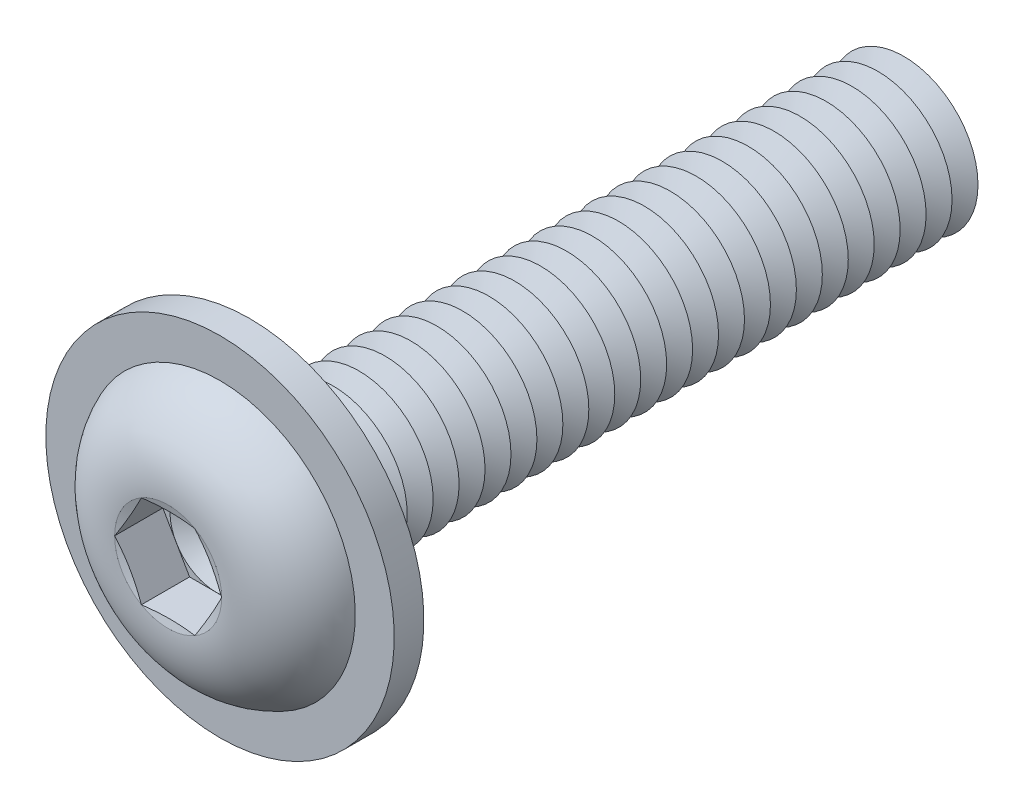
ISO-10303-21;
HEADER;
FILE_DESCRIPTION(('STEP AP214'),'2;1');
FILE_NAME('part.step','',(''),(''),'','','');
FILE_SCHEMA(('AUTOMOTIVE_DESIGN { 1 0 10303 214 1 1 1 1 }'));
ENDSEC;
DATA;
#1=APPLICATION_CONTEXT('core data for automotive mechanical design processes');
#2=APPLICATION_PROTOCOL_DEFINITION('international standard','automotive_design',2000,#1);
#3=PRODUCT_CONTEXT('',#1,'mechanical');
#4=PRODUCT('Part','Part','',(#3));
#5=PRODUCT_RELATED_PRODUCT_CATEGORY('part','',(#4));
#6=PRODUCT_DEFINITION_FORMATION('','',#4);
#7=PRODUCT_DEFINITION_CONTEXT('part definition',#1,'design');
#8=PRODUCT_DEFINITION('design','',#6,#7);
#9=PRODUCT_DEFINITION_SHAPE('','',#8);
#10=(LENGTH_UNIT() NAMED_UNIT(*) SI_UNIT(.MILLI.,.METRE.));
#11=(NAMED_UNIT(*) PLANE_ANGLE_UNIT() SI_UNIT($,.RADIAN.));
#12=(NAMED_UNIT(*) SI_UNIT($,.STERADIAN.) SOLID_ANGLE_UNIT());
#13=UNCERTAINTY_MEASURE_WITH_UNIT(LENGTH_MEASURE(1.E-05),#10,'distance_accuracy_value','');
#14=(GEOMETRIC_REPRESENTATION_CONTEXT(3) GLOBAL_UNCERTAINTY_ASSIGNED_CONTEXT((#13)) GLOBAL_UNIT_ASSIGNED_CONTEXT((#10,
#11,#12)) REPRESENTATION_CONTEXT('',''));
#15=CARTESIAN_POINT('',(0.,0.,0.));
#16=DIRECTION('',(0.,0.,1.));
#17=DIRECTION('',(1.,0.,0.));
#18=AXIS2_PLACEMENT_3D('',#15,#16,#17);
#19=CARTESIAN_POINT('',(0.,0.,-15.55));
#20=DIRECTION('',(0.,0.,1.));
#21=DIRECTION('',(1.,0.,0.));
#22=AXIS2_PLACEMENT_3D('',#19,#20,#21);
#23=CONICAL_SURFACE('',#22,2.,1.0471975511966);
#24=CARTESIAN_POINT('',(0.,0.,-15.9));
#25=DIRECTION('',(0.,0.,1.));
#26=DIRECTION('',(1.,0.,0.));
#27=AXIS2_PLACEMENT_3D('',#24,#25,#26);
#28=CIRCLE('',#27,1.3937822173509);
#29=CARTESIAN_POINT('',(1.3937822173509,0.,-15.9));
#30=VERTEX_POINT('',#29);
#31=EDGE_CURVE('E410',#30,#30,#28,.T.);
#32=ORIENTED_EDGE('',*,*,#31,.T.);
#33=EDGE_LOOP('',(#32));
#34=FACE_BOUND('',#33,.T.);
#35=CARTESIAN_POINT('',(0.,0.,-15.55));
#36=DIRECTION('',(0.,0.,1.));
#37=DIRECTION('',(1.,0.,0.));
#38=AXIS2_PLACEMENT_3D('',#35,#36,#37);
#39=CIRCLE('',#38,2.);
#40=CARTESIAN_POINT('',(2.,0.,-15.55));
#41=VERTEX_POINT('',#40);
#42=EDGE_CURVE('E406',#41,#41,#39,.T.);
#43=ORIENTED_EDGE('',*,*,#42,.F.);
#44=EDGE_LOOP('',(#43));
#45=FACE_BOUND('',#44,.T.);
#46=ADVANCED_FACE('F39',(#34,#45),#23,.T.);
#47=CARTESIAN_POINT('',(0.,0.,-15.9));
#48=DIRECTION('',(0.,0.,-1.));
#49=DIRECTION('',(-1.,0.,0.));
#50=AXIS2_PLACEMENT_3D('',#47,#48,#49);
#51=CONICAL_SURFACE('',#50,1.3937822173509,1.0471975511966);
#52=CARTESIAN_POINT('',(0.,0.,-16.25));
#53=DIRECTION('',(0.,0.,1.));
#54=DIRECTION('',(1.,0.,0.));
#55=AXIS2_PLACEMENT_3D('',#52,#53,#54);
#56=CIRCLE('',#55,2.);
#57=CARTESIAN_POINT('',(2.,0.,-16.25));
#58=VERTEX_POINT('',#57);
#59=EDGE_CURVE('E414',#58,#58,#56,.T.);
#60=ORIENTED_EDGE('',*,*,#59,.T.);
#61=EDGE_LOOP('',(#60));
#62=FACE_BOUND('',#61,.T.);
#63=ORIENTED_EDGE('',*,*,#31,.F.);
#64=EDGE_LOOP('',(#63));
#65=FACE_BOUND('',#64,.T.);
#66=ADVANCED_FACE('F545',(#62,#65),#51,.T.);
#67=CARTESIAN_POINT('',(0.,2.00000000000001,-18.));
#68=DIRECTION('',(0.,0.,-1.));
#69=DIRECTION('',(-1.,0.,0.));
#70=AXIS2_PLACEMENT_3D('',#67,#68,#69);
#71=PLANE('',#70);
#72=CARTESIAN_POINT('',(0.,0.,-18.));
#73=DIRECTION('',(0.,0.,1.));
#74=DIRECTION('',(1.,0.,0.));
#75=AXIS2_PLACEMENT_3D('',#72,#73,#74);
#76=CIRCLE('',#75,1.3937822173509);
#77=CARTESIAN_POINT('',(1.3937822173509,0.,-18.));
#78=VERTEX_POINT('',#77);
#79=EDGE_CURVE('E434',#78,#78,#76,.T.);
#80=ORIENTED_EDGE('',*,*,#79,.F.);
#81=EDGE_LOOP('',(#80));
#82=FACE_BOUND('',#81,.T.);
#83=ADVANCED_FACE('F551',(#82),#71,.T.);
#84=CARTESIAN_POINT('',(0.,0.,-17.65));
#85=DIRECTION('',(0.,0.,1.));
#86=DIRECTION('',(1.,0.,0.));
#87=AXIS2_PLACEMENT_3D('',#84,#85,#86);
#88=CONICAL_SURFACE('',#87,2.,1.0471975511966);
#89=ORIENTED_EDGE('',*,*,#79,.T.);
#90=EDGE_LOOP('',(#89));
#91=FACE_BOUND('',#90,.T.);
#92=CARTESIAN_POINT('',(0.,0.,-17.65));
#93=DIRECTION('',(0.,0.,1.));
#94=DIRECTION('',(1.,0.,0.));
#95=AXIS2_PLACEMENT_3D('',#92,#93,#94);
#96=CIRCLE('',#95,2.);
#97=CARTESIAN_POINT('',(2.,0.,-17.65));
#98=VERTEX_POINT('',#97);
#99=EDGE_CURVE('E430',#98,#98,#96,.T.);
#100=ORIENTED_EDGE('',*,*,#99,.F.);
#101=EDGE_LOOP('',(#100));
#102=FACE_BOUND('',#101,.T.);
#103=ADVANCED_FACE('F570',(#91,#102),#88,.T.);
#104=CARTESIAN_POINT('',(0.,0.,-17.3));
#105=DIRECTION('',(0.,0.,-1.));
#106=DIRECTION('',(-1.,0.,0.));
#107=AXIS2_PLACEMENT_3D('',#104,#105,#106);
#108=CONICAL_SURFACE('',#107,1.3937822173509,1.0471975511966);
#109=ORIENTED_EDGE('',*,*,#99,.T.);
#110=EDGE_LOOP('',(#109));
#111=FACE_BOUND('',#110,.T.);
#112=CARTESIAN_POINT('',(0.,0.,-17.3));
#113=DIRECTION('',(0.,0.,1.));
#114=DIRECTION('',(1.,0.,0.));
#115=AXIS2_PLACEMENT_3D('',#112,#113,#114);
#116=CIRCLE('',#115,1.3937822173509);
#117=CARTESIAN_POINT('',(1.3937822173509,0.,-17.3));
#118=VERTEX_POINT('',#117);
#119=EDGE_CURVE('E426',#118,#118,#116,.T.);
#120=ORIENTED_EDGE('',*,*,#119,.F.);
#121=EDGE_LOOP('',(#120));
#122=FACE_BOUND('',#121,.T.);
#123=ADVANCED_FACE('F567',(#111,#122),#108,.T.);
#124=CARTESIAN_POINT('',(0.,0.,-16.95));
#125=DIRECTION('',(0.,0.,1.));
#126=DIRECTION('',(1.,0.,0.));
#127=AXIS2_PLACEMENT_3D('',#124,#125,#126);
#128=CONICAL_SURFACE('',#127,2.,1.0471975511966);
#129=ORIENTED_EDGE('',*,*,#119,.T.);
#130=EDGE_LOOP('',(#129));
#131=FACE_BOUND('',#130,.T.);
#132=CARTESIAN_POINT('',(0.,0.,-16.95));
#133=DIRECTION('',(0.,0.,1.));
#134=DIRECTION('',(1.,0.,0.));
#135=AXIS2_PLACEMENT_3D('',#132,#133,#134);
#136=CIRCLE('',#135,2.);
#137=CARTESIAN_POINT('',(2.,0.,-16.95));
#138=VERTEX_POINT('',#137);
#139=EDGE_CURVE('E422',#138,#138,#136,.T.);
#140=ORIENTED_EDGE('',*,*,#139,.F.);
#141=EDGE_LOOP('',(#140));
#142=FACE_BOUND('',#141,.T.);
#143=ADVANCED_FACE('F561',(#131,#142),#128,.T.);
#144=CARTESIAN_POINT('',(0.,0.,-16.6));
#145=DIRECTION('',(0.,0.,-1.));
#146=DIRECTION('',(-1.,0.,0.));
#147=AXIS2_PLACEMENT_3D('',#144,#145,#146);
#148=CONICAL_SURFACE('',#147,1.3937822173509,1.0471975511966);
#149=ORIENTED_EDGE('',*,*,#139,.T.);
#150=EDGE_LOOP('',(#149));
#151=FACE_BOUND('',#150,.T.);
#152=CARTESIAN_POINT('',(0.,0.,-16.6));
#153=DIRECTION('',(0.,0.,1.));
#154=DIRECTION('',(1.,0.,0.));
#155=AXIS2_PLACEMENT_3D('',#152,#153,#154);
#156=CIRCLE('',#155,1.3937822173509);
#157=CARTESIAN_POINT('',(1.3937822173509,0.,-16.6));
#158=VERTEX_POINT('',#157);
#159=EDGE_CURVE('E418',#158,#158,#156,.T.);
#160=ORIENTED_EDGE('',*,*,#159,.F.);
#161=EDGE_LOOP('',(#160));
#162=FACE_BOUND('',#161,.T.);
#163=ADVANCED_FACE('F557',(#151,#162),#148,.T.);
#164=CARTESIAN_POINT('',(0.,0.,-16.25));
#165=DIRECTION('',(0.,0.,1.));
#166=DIRECTION('',(1.,0.,0.));
#167=AXIS2_PLACEMENT_3D('',#164,#165,#166);
#168=CONICAL_SURFACE('',#167,2.,1.0471975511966);
#169=ORIENTED_EDGE('',*,*,#159,.T.);
#170=EDGE_LOOP('',(#169));
#171=FACE_BOUND('',#170,.T.);
#172=ORIENTED_EDGE('',*,*,#59,.F.);
#173=EDGE_LOOP('',(#172));
#174=FACE_BOUND('',#173,.T.);
#175=ADVANCED_FACE('F560',(#171,#174),#168,.T.);
#176=CARTESIAN_POINT('',(0.,0.,-14.85));
#177=DIRECTION('',(0.,0.,1.));
#178=DIRECTION('',(1.,0.,0.));
#179=AXIS2_PLACEMENT_3D('',#176,#177,#178);
#180=CONICAL_SURFACE('',#179,2.,1.0471975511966);
#181=CARTESIAN_POINT('',(0.,0.,-15.2));
#182=DIRECTION('',(0.,0.,1.));
#183=DIRECTION('',(1.,0.,0.));
#184=AXIS2_PLACEMENT_3D('',#181,#182,#183);
#185=CIRCLE('',#184,1.3937822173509);
#186=CARTESIAN_POINT('',(1.3937822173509,0.,-15.2));
#187=VERTEX_POINT('',#186);
#188=EDGE_CURVE('E402',#187,#187,#185,.T.);
#189=ORIENTED_EDGE('',*,*,#188,.T.);
#190=EDGE_LOOP('',(#189));
#191=FACE_BOUND('',#190,.T.);
#192=CARTESIAN_POINT('',(0.,0.,-14.85));
#193=DIRECTION('',(0.,0.,1.));
#194=DIRECTION('',(1.,0.,0.));
#195=AXIS2_PLACEMENT_3D('',#192,#193,#194);
#196=CIRCLE('',#195,2.);
#197=CARTESIAN_POINT('',(2.,0.,-14.85));
#198=VERTEX_POINT('',#197);
#199=EDGE_CURVE('E398',#198,#198,#196,.T.);
#200=ORIENTED_EDGE('',*,*,#199,.F.);
#201=EDGE_LOOP('',(#200));
#202=FACE_BOUND('',#201,.T.);
#203=ADVANCED_FACE('F565',(#191,#202),#180,.T.);
#204=CARTESIAN_POINT('',(0.,0.,-15.2));
#205=DIRECTION('',(0.,0.,-1.));
#206=DIRECTION('',(-1.,0.,0.));
#207=AXIS2_PLACEMENT_3D('',#204,#205,#206);
#208=CONICAL_SURFACE('',#207,1.3937822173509,1.0471975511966);
#209=ORIENTED_EDGE('',*,*,#42,.T.);
#210=EDGE_LOOP('',(#209));
#211=FACE_BOUND('',#210,.T.);
#212=ORIENTED_EDGE('',*,*,#188,.F.);
#213=EDGE_LOOP('',(#212));
#214=FACE_BOUND('',#213,.T.);
#215=ADVANCED_FACE('F616',(#211,#214),#208,.T.);
#216=CARTESIAN_POINT('',(0.,0.,-14.15));
#217=DIRECTION('',(0.,0.,1.));
#218=DIRECTION('',(1.,0.,0.));
#219=AXIS2_PLACEMENT_3D('',#216,#217,#218);
#220=CONICAL_SURFACE('',#219,2.,1.0471975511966);
#221=CARTESIAN_POINT('',(0.,0.,-14.5));
#222=DIRECTION('',(0.,0.,1.));
#223=DIRECTION('',(1.,0.,0.));
#224=AXIS2_PLACEMENT_3D('',#221,#222,#223);
#225=CIRCLE('',#224,1.3937822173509);
#226=CARTESIAN_POINT('',(1.3937822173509,0.,-14.5));
#227=VERTEX_POINT('',#226);
#228=EDGE_CURVE('E394',#227,#227,#225,.T.);
#229=ORIENTED_EDGE('',*,*,#228,.T.);
#230=EDGE_LOOP('',(#229));
#231=FACE_BOUND('',#230,.T.);
#232=CARTESIAN_POINT('',(0.,0.,-14.15));
#233=DIRECTION('',(0.,0.,1.));
#234=DIRECTION('',(1.,0.,0.));
#235=AXIS2_PLACEMENT_3D('',#232,#233,#234);
#236=CIRCLE('',#235,2.);
#237=CARTESIAN_POINT('',(2.,0.,-14.15));
#238=VERTEX_POINT('',#237);
#239=EDGE_CURVE('E390',#238,#238,#236,.T.);
#240=ORIENTED_EDGE('',*,*,#239,.F.);
#241=EDGE_LOOP('',(#240));
#242=FACE_BOUND('',#241,.T.);
#243=ADVANCED_FACE('F622',(#231,#242),#220,.T.);
#244=CARTESIAN_POINT('',(0.,0.,-14.5));
#245=DIRECTION('',(0.,0.,-1.));
#246=DIRECTION('',(-1.,0.,0.));
#247=AXIS2_PLACEMENT_3D('',#244,#245,#246);
#248=CONICAL_SURFACE('',#247,1.3937822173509,1.0471975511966);
#249=ORIENTED_EDGE('',*,*,#199,.T.);
#250=EDGE_LOOP('',(#249));
#251=FACE_BOUND('',#250,.T.);
#252=ORIENTED_EDGE('',*,*,#228,.F.);
#253=EDGE_LOOP('',(#252));
#254=FACE_BOUND('',#253,.T.);
#255=ADVANCED_FACE('F629',(#251,#254),#248,.T.);
#256=CARTESIAN_POINT('',(0.,0.,-13.45));
#257=DIRECTION('',(0.,0.,1.));
#258=DIRECTION('',(1.,0.,0.));
#259=AXIS2_PLACEMENT_3D('',#256,#257,#258);
#260=CONICAL_SURFACE('',#259,2.,1.0471975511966);
#261=CARTESIAN_POINT('',(0.,0.,-13.8));
#262=DIRECTION('',(0.,0.,1.));
#263=DIRECTION('',(1.,0.,0.));
#264=AXIS2_PLACEMENT_3D('',#261,#262,#263);
#265=CIRCLE('',#264,1.3937822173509);
#266=CARTESIAN_POINT('',(1.3937822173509,0.,-13.8));
#267=VERTEX_POINT('',#266);
#268=EDGE_CURVE('E386',#267,#267,#265,.T.);
#269=ORIENTED_EDGE('',*,*,#268,.T.);
#270=EDGE_LOOP('',(#269));
#271=FACE_BOUND('',#270,.T.);
#272=CARTESIAN_POINT('',(0.,0.,-13.45));
#273=DIRECTION('',(0.,0.,1.));
#274=DIRECTION('',(1.,0.,0.));
#275=AXIS2_PLACEMENT_3D('',#272,#273,#274);
#276=CIRCLE('',#275,2.);
#277=CARTESIAN_POINT('',(2.,0.,-13.45));
#278=VERTEX_POINT('',#277);
#279=EDGE_CURVE('E382',#278,#278,#276,.T.);
#280=ORIENTED_EDGE('',*,*,#279,.F.);
#281=EDGE_LOOP('',(#280));
#282=FACE_BOUND('',#281,.T.);
#283=ADVANCED_FACE('F636',(#271,#282),#260,.T.);
#284=CARTESIAN_POINT('',(0.,0.,-13.8));
#285=DIRECTION('',(0.,0.,-1.));
#286=DIRECTION('',(-1.,0.,0.));
#287=AXIS2_PLACEMENT_3D('',#284,#285,#286);
#288=CONICAL_SURFACE('',#287,1.3937822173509,1.0471975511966);
#289=ORIENTED_EDGE('',*,*,#239,.T.);
#290=EDGE_LOOP('',(#289));
#291=FACE_BOUND('',#290,.T.);
#292=ORIENTED_EDGE('',*,*,#268,.F.);
#293=EDGE_LOOP('',(#292));
#294=FACE_BOUND('',#293,.T.);
#295=ADVANCED_FACE('F643',(#291,#294),#288,.T.);
#296=CARTESIAN_POINT('',(0.,0.,-12.75));
#297=DIRECTION('',(0.,0.,1.));
#298=DIRECTION('',(1.,0.,0.));
#299=AXIS2_PLACEMENT_3D('',#296,#297,#298);
#300=CONICAL_SURFACE('',#299,2.,1.0471975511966);
#301=CARTESIAN_POINT('',(0.,0.,-13.1));
#302=DIRECTION('',(0.,0.,1.));
#303=DIRECTION('',(1.,0.,0.));
#304=AXIS2_PLACEMENT_3D('',#301,#302,#303);
#305=CIRCLE('',#304,1.3937822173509);
#306=CARTESIAN_POINT('',(1.3937822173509,0.,-13.1));
#307=VERTEX_POINT('',#306);
#308=EDGE_CURVE('E378',#307,#307,#305,.T.);
#309=ORIENTED_EDGE('',*,*,#308,.T.);
#310=EDGE_LOOP('',(#309));
#311=FACE_BOUND('',#310,.T.);
#312=CARTESIAN_POINT('',(0.,0.,-12.75));
#313=DIRECTION('',(0.,0.,1.));
#314=DIRECTION('',(1.,0.,0.));
#315=AXIS2_PLACEMENT_3D('',#312,#313,#314);
#316=CIRCLE('',#315,2.);
#317=CARTESIAN_POINT('',(2.,0.,-12.75));
#318=VERTEX_POINT('',#317);
#319=EDGE_CURVE('E374',#318,#318,#316,.T.);
#320=ORIENTED_EDGE('',*,*,#319,.F.);
#321=EDGE_LOOP('',(#320));
#322=FACE_BOUND('',#321,.T.);
#323=ADVANCED_FACE('F650',(#311,#322),#300,.T.);
#324=CARTESIAN_POINT('',(0.,0.,-13.1));
#325=DIRECTION('',(0.,0.,-1.));
#326=DIRECTION('',(-1.,0.,0.));
#327=AXIS2_PLACEMENT_3D('',#324,#325,#326);
#328=CONICAL_SURFACE('',#327,1.3937822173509,1.0471975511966);
#329=ORIENTED_EDGE('',*,*,#279,.T.);
#330=EDGE_LOOP('',(#329));
#331=FACE_BOUND('',#330,.T.);
#332=ORIENTED_EDGE('',*,*,#308,.F.);
#333=EDGE_LOOP('',(#332));
#334=FACE_BOUND('',#333,.T.);
#335=ADVANCED_FACE('F657',(#331,#334),#328,.T.);
#336=CARTESIAN_POINT('',(0.,0.,-12.05));
#337=DIRECTION('',(0.,0.,1.));
#338=DIRECTION('',(1.,0.,0.));
#339=AXIS2_PLACEMENT_3D('',#336,#337,#338);
#340=CONICAL_SURFACE('',#339,2.,1.0471975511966);
#341=CARTESIAN_POINT('',(0.,0.,-12.4));
#342=DIRECTION('',(0.,0.,1.));
#343=DIRECTION('',(1.,0.,0.));
#344=AXIS2_PLACEMENT_3D('',#341,#342,#343);
#345=CIRCLE('',#344,1.3937822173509);
#346=CARTESIAN_POINT('',(1.3937822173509,0.,-12.4));
#347=VERTEX_POINT('',#346);
#348=EDGE_CURVE('E370',#347,#347,#345,.T.);
#349=ORIENTED_EDGE('',*,*,#348,.T.);
#350=EDGE_LOOP('',(#349));
#351=FACE_BOUND('',#350,.T.);
#352=CARTESIAN_POINT('',(0.,0.,-12.05));
#353=DIRECTION('',(0.,0.,1.));
#354=DIRECTION('',(1.,0.,0.));
#355=AXIS2_PLACEMENT_3D('',#352,#353,#354);
#356=CIRCLE('',#355,2.);
#357=CARTESIAN_POINT('',(2.,0.,-12.05));
#358=VERTEX_POINT('',#357);
#359=EDGE_CURVE('E366',#358,#358,#356,.T.);
#360=ORIENTED_EDGE('',*,*,#359,.F.);
#361=EDGE_LOOP('',(#360));
#362=FACE_BOUND('',#361,.T.);
#363=ADVANCED_FACE('F664',(#351,#362),#340,.T.);
#364=CARTESIAN_POINT('',(0.,0.,-12.4));
#365=DIRECTION('',(0.,0.,-1.));
#366=DIRECTION('',(-1.,0.,0.));
#367=AXIS2_PLACEMENT_3D('',#364,#365,#366);
#368=CONICAL_SURFACE('',#367,1.3937822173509,1.0471975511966);
#369=ORIENTED_EDGE('',*,*,#319,.T.);
#370=EDGE_LOOP('',(#369));
#371=FACE_BOUND('',#370,.T.);
#372=ORIENTED_EDGE('',*,*,#348,.F.);
#373=EDGE_LOOP('',(#372));
#374=FACE_BOUND('',#373,.T.);
#375=ADVANCED_FACE('F671',(#371,#374),#368,.T.);
#376=CARTESIAN_POINT('',(0.,0.,-11.35));
#377=DIRECTION('',(0.,0.,1.));
#378=DIRECTION('',(1.,0.,0.));
#379=AXIS2_PLACEMENT_3D('',#376,#377,#378);
#380=CONICAL_SURFACE('',#379,2.,1.0471975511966);
#381=CARTESIAN_POINT('',(0.,0.,-11.7));
#382=DIRECTION('',(0.,0.,1.));
#383=DIRECTION('',(1.,0.,0.));
#384=AXIS2_PLACEMENT_3D('',#381,#382,#383);
#385=CIRCLE('',#384,1.3937822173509);
#386=CARTESIAN_POINT('',(1.3937822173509,0.,-11.7));
#387=VERTEX_POINT('',#386);
#388=EDGE_CURVE('E362',#387,#387,#385,.T.);
#389=ORIENTED_EDGE('',*,*,#388,.T.);
#390=EDGE_LOOP('',(#389));
#391=FACE_BOUND('',#390,.T.);
#392=CARTESIAN_POINT('',(0.,0.,-11.35));
#393=DIRECTION('',(0.,0.,1.));
#394=DIRECTION('',(1.,0.,0.));
#395=AXIS2_PLACEMENT_3D('',#392,#393,#394);
#396=CIRCLE('',#395,2.);
#397=CARTESIAN_POINT('',(2.,0.,-11.35));
#398=VERTEX_POINT('',#397);
#399=EDGE_CURVE('E358',#398,#398,#396,.T.);
#400=ORIENTED_EDGE('',*,*,#399,.F.);
#401=EDGE_LOOP('',(#400));
#402=FACE_BOUND('',#401,.T.);
#403=ADVANCED_FACE('F678',(#391,#402),#380,.T.);
#404=CARTESIAN_POINT('',(0.,0.,-11.7));
#405=DIRECTION('',(0.,0.,-1.));
#406=DIRECTION('',(-1.,0.,0.));
#407=AXIS2_PLACEMENT_3D('',#404,#405,#406);
#408=CONICAL_SURFACE('',#407,1.3937822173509,1.0471975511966);
#409=ORIENTED_EDGE('',*,*,#359,.T.);
#410=EDGE_LOOP('',(#409));
#411=FACE_BOUND('',#410,.T.);
#412=ORIENTED_EDGE('',*,*,#388,.F.);
#413=EDGE_LOOP('',(#412));
#414=FACE_BOUND('',#413,.T.);
#415=ADVANCED_FACE('F685',(#411,#414),#408,.T.);
#416=CARTESIAN_POINT('',(0.,0.,-10.65));
#417=DIRECTION('',(0.,0.,1.));
#418=DIRECTION('',(1.,0.,0.));
#419=AXIS2_PLACEMENT_3D('',#416,#417,#418);
#420=CONICAL_SURFACE('',#419,2.,1.0471975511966);
#421=CARTESIAN_POINT('',(0.,0.,-11.));
#422=DIRECTION('',(0.,0.,1.));
#423=DIRECTION('',(1.,0.,0.));
#424=AXIS2_PLACEMENT_3D('',#421,#422,#423);
#425=CIRCLE('',#424,1.3937822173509);
#426=CARTESIAN_POINT('',(1.3937822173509,0.,-11.));
#427=VERTEX_POINT('',#426);
#428=EDGE_CURVE('E354',#427,#427,#425,.T.);
#429=ORIENTED_EDGE('',*,*,#428,.T.);
#430=EDGE_LOOP('',(#429));
#431=FACE_BOUND('',#430,.T.);
#432=CARTESIAN_POINT('',(0.,0.,-10.65));
#433=DIRECTION('',(0.,0.,1.));
#434=DIRECTION('',(1.,0.,0.));
#435=AXIS2_PLACEMENT_3D('',#432,#433,#434);
#436=CIRCLE('',#435,2.);
#437=CARTESIAN_POINT('',(2.,0.,-10.65));
#438=VERTEX_POINT('',#437);
#439=EDGE_CURVE('E350',#438,#438,#436,.T.);
#440=ORIENTED_EDGE('',*,*,#439,.F.);
#441=EDGE_LOOP('',(#440));
#442=FACE_BOUND('',#441,.T.);
#443=ADVANCED_FACE('F692',(#431,#442),#420,.T.);
#444=CARTESIAN_POINT('',(0.,0.,-11.));
#445=DIRECTION('',(0.,0.,-1.));
#446=DIRECTION('',(-1.,0.,0.));
#447=AXIS2_PLACEMENT_3D('',#444,#445,#446);
#448=CONICAL_SURFACE('',#447,1.3937822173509,1.0471975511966);
#449=ORIENTED_EDGE('',*,*,#399,.T.);
#450=EDGE_LOOP('',(#449));
#451=FACE_BOUND('',#450,.T.);
#452=ORIENTED_EDGE('',*,*,#428,.F.);
#453=EDGE_LOOP('',(#452));
#454=FACE_BOUND('',#453,.T.);
#455=ADVANCED_FACE('F699',(#451,#454),#448,.T.);
#456=CARTESIAN_POINT('',(0.,0.,-9.95));
#457=DIRECTION('',(0.,0.,1.));
#458=DIRECTION('',(1.,0.,0.));
#459=AXIS2_PLACEMENT_3D('',#456,#457,#458);
#460=CONICAL_SURFACE('',#459,2.,1.0471975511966);
#461=CARTESIAN_POINT('',(0.,0.,-10.3));
#462=DIRECTION('',(0.,0.,1.));
#463=DIRECTION('',(1.,0.,0.));
#464=AXIS2_PLACEMENT_3D('',#461,#462,#463);
#465=CIRCLE('',#464,1.3937822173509);
#466=CARTESIAN_POINT('',(1.3937822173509,0.,-10.3));
#467=VERTEX_POINT('',#466);
#468=EDGE_CURVE('E346',#467,#467,#465,.T.);
#469=ORIENTED_EDGE('',*,*,#468,.T.);
#470=EDGE_LOOP('',(#469));
#471=FACE_BOUND('',#470,.T.);
#472=CARTESIAN_POINT('',(0.,0.,-9.95));
#473=DIRECTION('',(0.,0.,1.));
#474=DIRECTION('',(1.,0.,0.));
#475=AXIS2_PLACEMENT_3D('',#472,#473,#474);
#476=CIRCLE('',#475,2.);
#477=CARTESIAN_POINT('',(2.,0.,-9.95));
#478=VERTEX_POINT('',#477);
#479=EDGE_CURVE('E342',#478,#478,#476,.T.);
#480=ORIENTED_EDGE('',*,*,#479,.F.);
#481=EDGE_LOOP('',(#480));
#482=FACE_BOUND('',#481,.T.);
#483=ADVANCED_FACE('F706',(#471,#482),#460,.T.);
#484=CARTESIAN_POINT('',(0.,0.,-10.3));
#485=DIRECTION('',(0.,0.,-1.));
#486=DIRECTION('',(-1.,0.,0.));
#487=AXIS2_PLACEMENT_3D('',#484,#485,#486);
#488=CONICAL_SURFACE('',#487,1.3937822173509,1.0471975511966);
#489=ORIENTED_EDGE('',*,*,#439,.T.);
#490=EDGE_LOOP('',(#489));
#491=FACE_BOUND('',#490,.T.);
#492=ORIENTED_EDGE('',*,*,#468,.F.);
#493=EDGE_LOOP('',(#492));
#494=FACE_BOUND('',#493,.T.);
#495=ADVANCED_FACE('F713',(#491,#494),#488,.T.);
#496=CARTESIAN_POINT('',(0.,0.,-9.25));
#497=DIRECTION('',(0.,0.,1.));
#498=DIRECTION('',(1.,0.,0.));
#499=AXIS2_PLACEMENT_3D('',#496,#497,#498);
#500=CONICAL_SURFACE('',#499,2.,1.0471975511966);
#501=CARTESIAN_POINT('',(0.,0.,-9.6));
#502=DIRECTION('',(0.,0.,1.));
#503=DIRECTION('',(1.,0.,0.));
#504=AXIS2_PLACEMENT_3D('',#501,#502,#503);
#505=CIRCLE('',#504,1.3937822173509);
#506=CARTESIAN_POINT('',(1.3937822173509,0.,-9.6));
#507=VERTEX_POINT('',#506);
#508=EDGE_CURVE('E338',#507,#507,#505,.T.);
#509=ORIENTED_EDGE('',*,*,#508,.T.);
#510=EDGE_LOOP('',(#509));
#511=FACE_BOUND('',#510,.T.);
#512=CARTESIAN_POINT('',(0.,0.,-9.25));
#513=DIRECTION('',(0.,0.,1.));
#514=DIRECTION('',(1.,0.,0.));
#515=AXIS2_PLACEMENT_3D('',#512,#513,#514);
#516=CIRCLE('',#515,2.);
#517=CARTESIAN_POINT('',(2.,0.,-9.25));
#518=VERTEX_POINT('',#517);
#519=EDGE_CURVE('E334',#518,#518,#516,.T.);
#520=ORIENTED_EDGE('',*,*,#519,.F.);
#521=EDGE_LOOP('',(#520));
#522=FACE_BOUND('',#521,.T.);
#523=ADVANCED_FACE('F720',(#511,#522),#500,.T.);
#524=CARTESIAN_POINT('',(0.,0.,-9.6));
#525=DIRECTION('',(0.,0.,-1.));
#526=DIRECTION('',(-1.,0.,0.));
#527=AXIS2_PLACEMENT_3D('',#524,#525,#526);
#528=CONICAL_SURFACE('',#527,1.3937822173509,1.0471975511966);
#529=ORIENTED_EDGE('',*,*,#479,.T.);
#530=EDGE_LOOP('',(#529));
#531=FACE_BOUND('',#530,.T.);
#532=ORIENTED_EDGE('',*,*,#508,.F.);
#533=EDGE_LOOP('',(#532));
#534=FACE_BOUND('',#533,.T.);
#535=ADVANCED_FACE('F727',(#531,#534),#528,.T.);
#536=CARTESIAN_POINT('',(0.,0.,-8.55));
#537=DIRECTION('',(0.,0.,1.));
#538=DIRECTION('',(1.,0.,0.));
#539=AXIS2_PLACEMENT_3D('',#536,#537,#538);
#540=CONICAL_SURFACE('',#539,2.,1.0471975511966);
#541=CARTESIAN_POINT('',(0.,0.,-8.9));
#542=DIRECTION('',(0.,0.,1.));
#543=DIRECTION('',(1.,0.,0.));
#544=AXIS2_PLACEMENT_3D('',#541,#542,#543);
#545=CIRCLE('',#544,1.3937822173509);
#546=CARTESIAN_POINT('',(1.3937822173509,0.,-8.9));
#547=VERTEX_POINT('',#546);
#548=EDGE_CURVE('E330',#547,#547,#545,.T.);
#549=ORIENTED_EDGE('',*,*,#548,.T.);
#550=EDGE_LOOP('',(#549));
#551=FACE_BOUND('',#550,.T.);
#552=CARTESIAN_POINT('',(0.,0.,-8.55));
#553=DIRECTION('',(0.,0.,1.));
#554=DIRECTION('',(1.,0.,0.));
#555=AXIS2_PLACEMENT_3D('',#552,#553,#554);
#556=CIRCLE('',#555,2.);
#557=CARTESIAN_POINT('',(2.,0.,-8.55));
#558=VERTEX_POINT('',#557);
#559=EDGE_CURVE('E327',#558,#558,#556,.T.);
#560=ORIENTED_EDGE('',*,*,#559,.F.);
#561=EDGE_LOOP('',(#560));
#562=FACE_BOUND('',#561,.T.);
#563=ADVANCED_FACE('F734',(#551,#562),#540,.T.);
#564=CARTESIAN_POINT('',(0.,0.,-8.9));
#565=DIRECTION('',(0.,0.,-1.));
#566=DIRECTION('',(-1.,0.,0.));
#567=AXIS2_PLACEMENT_3D('',#564,#565,#566);
#568=CONICAL_SURFACE('',#567,1.3937822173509,1.0471975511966);
#569=ORIENTED_EDGE('',*,*,#519,.T.);
#570=EDGE_LOOP('',(#569));
#571=FACE_BOUND('',#570,.T.);
#572=ORIENTED_EDGE('',*,*,#548,.F.);
#573=EDGE_LOOP('',(#572));
#574=FACE_BOUND('',#573,.T.);
#575=ADVANCED_FACE('F741',(#571,#574),#568,.T.);
#576=CARTESIAN_POINT('',(0.,0.,-7.85));
#577=DIRECTION('',(0.,0.,1.));
#578=DIRECTION('',(1.,0.,0.));
#579=AXIS2_PLACEMENT_3D('',#576,#577,#578);
#580=CONICAL_SURFACE('',#579,2.,1.0471975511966);
#581=CARTESIAN_POINT('',(0.,0.,-8.2));
#582=DIRECTION('',(0.,0.,1.));
#583=DIRECTION('',(1.,0.,0.));
#584=AXIS2_PLACEMENT_3D('',#581,#582,#583);
#585=CIRCLE('',#584,1.3937822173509);
#586=CARTESIAN_POINT('',(1.3937822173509,0.,-8.2));
#587=VERTEX_POINT('',#586);
#588=EDGE_CURVE('E323',#587,#587,#585,.T.);
#589=ORIENTED_EDGE('',*,*,#588,.T.);
#590=EDGE_LOOP('',(#589));
#591=FACE_BOUND('',#590,.T.);
#592=CARTESIAN_POINT('',(0.,0.,-7.85));
#593=DIRECTION('',(0.,0.,1.));
#594=DIRECTION('',(1.,0.,0.));
#595=AXIS2_PLACEMENT_3D('',#592,#593,#594);
#596=CIRCLE('',#595,2.);
#597=CARTESIAN_POINT('',(2.,0.,-7.85));
#598=VERTEX_POINT('',#597);
#599=EDGE_CURVE('E319',#598,#598,#596,.T.);
#600=ORIENTED_EDGE('',*,*,#599,.F.);
#601=EDGE_LOOP('',(#600));
#602=FACE_BOUND('',#601,.T.);
#603=ADVANCED_FACE('F748',(#591,#602),#580,.T.);
#604=CARTESIAN_POINT('',(0.,0.,-8.2));
#605=DIRECTION('',(0.,0.,-1.));
#606=DIRECTION('',(-1.,0.,0.));
#607=AXIS2_PLACEMENT_3D('',#604,#605,#606);
#608=CONICAL_SURFACE('',#607,1.3937822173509,1.0471975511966);
#609=ORIENTED_EDGE('',*,*,#559,.T.);
#610=EDGE_LOOP('',(#609));
#611=FACE_BOUND('',#610,.T.);
#612=ORIENTED_EDGE('',*,*,#588,.F.);
#613=EDGE_LOOP('',(#612));
#614=FACE_BOUND('',#613,.T.);
#615=ADVANCED_FACE('F755',(#611,#614),#608,.T.);
#616=CARTESIAN_POINT('',(0.,0.,-7.15));
#617=DIRECTION('',(0.,0.,1.));
#618=DIRECTION('',(1.,0.,0.));
#619=AXIS2_PLACEMENT_3D('',#616,#617,#618);
#620=CONICAL_SURFACE('',#619,2.,1.0471975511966);
#621=CARTESIAN_POINT('',(0.,0.,-7.5));
#622=DIRECTION('',(0.,0.,1.));
#623=DIRECTION('',(1.,0.,0.));
#624=AXIS2_PLACEMENT_3D('',#621,#622,#623);
#625=CIRCLE('',#624,1.3937822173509);
#626=CARTESIAN_POINT('',(1.3937822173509,0.,-7.5));
#627=VERTEX_POINT('',#626);
#628=EDGE_CURVE('E315',#627,#627,#625,.T.);
#629=ORIENTED_EDGE('',*,*,#628,.T.);
#630=EDGE_LOOP('',(#629));
#631=FACE_BOUND('',#630,.T.);
#632=CARTESIAN_POINT('',(0.,0.,-7.15));
#633=DIRECTION('',(0.,0.,1.));
#634=DIRECTION('',(1.,0.,0.));
#635=AXIS2_PLACEMENT_3D('',#632,#633,#634);
#636=CIRCLE('',#635,2.);
#637=CARTESIAN_POINT('',(2.,0.,-7.15));
#638=VERTEX_POINT('',#637);
#639=EDGE_CURVE('E311',#638,#638,#636,.T.);
#640=ORIENTED_EDGE('',*,*,#639,.F.);
#641=EDGE_LOOP('',(#640));
#642=FACE_BOUND('',#641,.T.);
#643=ADVANCED_FACE('F762',(#631,#642),#620,.T.);
#644=CARTESIAN_POINT('',(0.,0.,-7.5));
#645=DIRECTION('',(0.,0.,-1.));
#646=DIRECTION('',(-1.,0.,0.));
#647=AXIS2_PLACEMENT_3D('',#644,#645,#646);
#648=CONICAL_SURFACE('',#647,1.3937822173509,1.0471975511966);
#649=ORIENTED_EDGE('',*,*,#599,.T.);
#650=EDGE_LOOP('',(#649));
#651=FACE_BOUND('',#650,.T.);
#652=ORIENTED_EDGE('',*,*,#628,.F.);
#653=EDGE_LOOP('',(#652));
#654=FACE_BOUND('',#653,.T.);
#655=ADVANCED_FACE('F769',(#651,#654),#648,.T.);
#656=CARTESIAN_POINT('',(0.,0.,-6.45));
#657=DIRECTION('',(0.,0.,1.));
#658=DIRECTION('',(1.,0.,0.));
#659=AXIS2_PLACEMENT_3D('',#656,#657,#658);
#660=CONICAL_SURFACE('',#659,2.,1.0471975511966);
#661=CARTESIAN_POINT('',(0.,0.,-6.8));
#662=DIRECTION('',(0.,0.,1.));
#663=DIRECTION('',(1.,0.,0.));
#664=AXIS2_PLACEMENT_3D('',#661,#662,#663);
#665=CIRCLE('',#664,1.3937822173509);
#666=CARTESIAN_POINT('',(1.3937822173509,0.,-6.8));
#667=VERTEX_POINT('',#666);
#668=EDGE_CURVE('E307',#667,#667,#665,.T.);
#669=ORIENTED_EDGE('',*,*,#668,.T.);
#670=EDGE_LOOP('',(#669));
#671=FACE_BOUND('',#670,.T.);
#672=CARTESIAN_POINT('',(0.,0.,-6.45));
#673=DIRECTION('',(0.,0.,1.));
#674=DIRECTION('',(1.,0.,0.));
#675=AXIS2_PLACEMENT_3D('',#672,#673,#674);
#676=CIRCLE('',#675,2.);
#677=CARTESIAN_POINT('',(2.,0.,-6.45));
#678=VERTEX_POINT('',#677);
#679=EDGE_CURVE('E303',#678,#678,#676,.T.);
#680=ORIENTED_EDGE('',*,*,#679,.F.);
#681=EDGE_LOOP('',(#680));
#682=FACE_BOUND('',#681,.T.);
#683=ADVANCED_FACE('F776',(#671,#682),#660,.T.);
#684=CARTESIAN_POINT('',(0.,0.,-6.8));
#685=DIRECTION('',(0.,0.,-1.));
#686=DIRECTION('',(-1.,0.,0.));
#687=AXIS2_PLACEMENT_3D('',#684,#685,#686);
#688=CONICAL_SURFACE('',#687,1.3937822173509,1.0471975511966);
#689=ORIENTED_EDGE('',*,*,#639,.T.);
#690=EDGE_LOOP('',(#689));
#691=FACE_BOUND('',#690,.T.);
#692=ORIENTED_EDGE('',*,*,#668,.F.);
#693=EDGE_LOOP('',(#692));
#694=FACE_BOUND('',#693,.T.);
#695=ADVANCED_FACE('F783',(#691,#694),#688,.T.);
#696=CARTESIAN_POINT('',(0.,0.,-5.75));
#697=DIRECTION('',(0.,0.,1.));
#698=DIRECTION('',(1.,0.,0.));
#699=AXIS2_PLACEMENT_3D('',#696,#697,#698);
#700=CONICAL_SURFACE('',#699,2.,1.0471975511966);
#701=CARTESIAN_POINT('',(0.,0.,-6.1));
#702=DIRECTION('',(0.,0.,1.));
#703=DIRECTION('',(1.,0.,0.));
#704=AXIS2_PLACEMENT_3D('',#701,#702,#703);
#705=CIRCLE('',#704,1.3937822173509);
#706=CARTESIAN_POINT('',(1.3937822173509,0.,-6.1));
#707=VERTEX_POINT('',#706);
#708=EDGE_CURVE('E299',#707,#707,#705,.T.);
#709=ORIENTED_EDGE('',*,*,#708,.T.);
#710=EDGE_LOOP('',(#709));
#711=FACE_BOUND('',#710,.T.);
#712=CARTESIAN_POINT('',(0.,0.,-5.75));
#713=DIRECTION('',(0.,0.,1.));
#714=DIRECTION('',(1.,0.,0.));
#715=AXIS2_PLACEMENT_3D('',#712,#713,#714);
#716=CIRCLE('',#715,2.);
#717=CARTESIAN_POINT('',(2.,0.,-5.75));
#718=VERTEX_POINT('',#717);
#719=EDGE_CURVE('E295',#718,#718,#716,.T.);
#720=ORIENTED_EDGE('',*,*,#719,.F.);
#721=EDGE_LOOP('',(#720));
#722=FACE_BOUND('',#721,.T.);
#723=ADVANCED_FACE('F790',(#711,#722),#700,.T.);
#724=CARTESIAN_POINT('',(0.,0.,-6.1));
#725=DIRECTION('',(0.,0.,-1.));
#726=DIRECTION('',(-1.,0.,0.));
#727=AXIS2_PLACEMENT_3D('',#724,#725,#726);
#728=CONICAL_SURFACE('',#727,1.3937822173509,1.0471975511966);
#729=ORIENTED_EDGE('',*,*,#679,.T.);
#730=EDGE_LOOP('',(#729));
#731=FACE_BOUND('',#730,.T.);
#732=ORIENTED_EDGE('',*,*,#708,.F.);
#733=EDGE_LOOP('',(#732));
#734=FACE_BOUND('',#733,.T.);
#735=ADVANCED_FACE('F797',(#731,#734),#728,.T.);
#736=CARTESIAN_POINT('',(0.,0.,-5.05));
#737=DIRECTION('',(0.,0.,1.));
#738=DIRECTION('',(1.,0.,0.));
#739=AXIS2_PLACEMENT_3D('',#736,#737,#738);
#740=CONICAL_SURFACE('',#739,2.,1.0471975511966);
#741=CARTESIAN_POINT('',(0.,0.,-5.4));
#742=DIRECTION('',(0.,0.,1.));
#743=DIRECTION('',(1.,0.,0.));
#744=AXIS2_PLACEMENT_3D('',#741,#742,#743);
#745=CIRCLE('',#744,1.3937822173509);
#746=CARTESIAN_POINT('',(1.3937822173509,0.,-5.4));
#747=VERTEX_POINT('',#746);
#748=EDGE_CURVE('E291',#747,#747,#745,.T.);
#749=ORIENTED_EDGE('',*,*,#748,.T.);
#750=EDGE_LOOP('',(#749));
#751=FACE_BOUND('',#750,.T.);
#752=CARTESIAN_POINT('',(0.,0.,-5.05));
#753=DIRECTION('',(0.,0.,1.));
#754=DIRECTION('',(1.,0.,0.));
#755=AXIS2_PLACEMENT_3D('',#752,#753,#754);
#756=CIRCLE('',#755,2.);
#757=CARTESIAN_POINT('',(2.,0.,-5.05));
#758=VERTEX_POINT('',#757);
#759=EDGE_CURVE('E287',#758,#758,#756,.T.);
#760=ORIENTED_EDGE('',*,*,#759,.F.);
#761=EDGE_LOOP('',(#760));
#762=FACE_BOUND('',#761,.T.);
#763=ADVANCED_FACE('F804',(#751,#762),#740,.T.);
#764=CARTESIAN_POINT('',(0.,0.,-5.4));
#765=DIRECTION('',(0.,0.,-1.));
#766=DIRECTION('',(-1.,0.,0.));
#767=AXIS2_PLACEMENT_3D('',#764,#765,#766);
#768=CONICAL_SURFACE('',#767,1.3937822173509,1.0471975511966);
#769=ORIENTED_EDGE('',*,*,#719,.T.);
#770=EDGE_LOOP('',(#769));
#771=FACE_BOUND('',#770,.T.);
#772=ORIENTED_EDGE('',*,*,#748,.F.);
#773=EDGE_LOOP('',(#772));
#774=FACE_BOUND('',#773,.T.);
#775=ADVANCED_FACE('F811',(#771,#774),#768,.T.);
#776=CARTESIAN_POINT('',(0.,0.,-4.35));
#777=DIRECTION('',(0.,0.,1.));
#778=DIRECTION('',(1.,0.,0.));
#779=AXIS2_PLACEMENT_3D('',#776,#777,#778);
#780=CONICAL_SURFACE('',#779,2.,1.0471975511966);
#781=CARTESIAN_POINT('',(0.,0.,-4.7));
#782=DIRECTION('',(0.,0.,1.));
#783=DIRECTION('',(1.,0.,0.));
#784=AXIS2_PLACEMENT_3D('',#781,#782,#783);
#785=CIRCLE('',#784,1.3937822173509);
#786=CARTESIAN_POINT('',(1.3937822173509,0.,-4.7));
#787=VERTEX_POINT('',#786);
#788=EDGE_CURVE('E283',#787,#787,#785,.T.);
#789=ORIENTED_EDGE('',*,*,#788,.T.);
#790=EDGE_LOOP('',(#789));
#791=FACE_BOUND('',#790,.T.);
#792=CARTESIAN_POINT('',(0.,0.,-4.35));
#793=DIRECTION('',(0.,0.,1.));
#794=DIRECTION('',(1.,0.,0.));
#795=AXIS2_PLACEMENT_3D('',#792,#793,#794);
#796=CIRCLE('',#795,2.);
#797=CARTESIAN_POINT('',(2.,0.,-4.35));
#798=VERTEX_POINT('',#797);
#799=EDGE_CURVE('E279',#798,#798,#796,.T.);
#800=ORIENTED_EDGE('',*,*,#799,.F.);
#801=EDGE_LOOP('',(#800));
#802=FACE_BOUND('',#801,.T.);
#803=ADVANCED_FACE('F818',(#791,#802),#780,.T.);
#804=CARTESIAN_POINT('',(0.,0.,-4.7));
#805=DIRECTION('',(0.,0.,-1.));
#806=DIRECTION('',(-1.,0.,0.));
#807=AXIS2_PLACEMENT_3D('',#804,#805,#806);
#808=CONICAL_SURFACE('',#807,1.3937822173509,1.0471975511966);
#809=ORIENTED_EDGE('',*,*,#759,.T.);
#810=EDGE_LOOP('',(#809));
#811=FACE_BOUND('',#810,.T.);
#812=ORIENTED_EDGE('',*,*,#788,.F.);
#813=EDGE_LOOP('',(#812));
#814=FACE_BOUND('',#813,.T.);
#815=ADVANCED_FACE('F825',(#811,#814),#808,.T.);
#816=CARTESIAN_POINT('',(0.,0.,-3.65));
#817=DIRECTION('',(0.,0.,1.));
#818=DIRECTION('',(1.,0.,0.));
#819=AXIS2_PLACEMENT_3D('',#816,#817,#818);
#820=CONICAL_SURFACE('',#819,2.,1.0471975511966);
#821=CARTESIAN_POINT('',(0.,0.,-4.));
#822=DIRECTION('',(0.,0.,1.));
#823=DIRECTION('',(1.,0.,0.));
#824=AXIS2_PLACEMENT_3D('',#821,#822,#823);
#825=CIRCLE('',#824,1.3937822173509);
#826=CARTESIAN_POINT('',(1.3937822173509,0.,-4.));
#827=VERTEX_POINT('',#826);
#828=EDGE_CURVE('E275',#827,#827,#825,.T.);
#829=ORIENTED_EDGE('',*,*,#828,.T.);
#830=EDGE_LOOP('',(#829));
#831=FACE_BOUND('',#830,.T.);
#832=CARTESIAN_POINT('',(0.,0.,-3.65));
#833=DIRECTION('',(0.,0.,1.));
#834=DIRECTION('',(1.,0.,0.));
#835=AXIS2_PLACEMENT_3D('',#832,#833,#834);
#836=CIRCLE('',#835,2.);
#837=CARTESIAN_POINT('',(2.,0.,-3.65));
#838=VERTEX_POINT('',#837);
#839=EDGE_CURVE('E271',#838,#838,#836,.T.);
#840=ORIENTED_EDGE('',*,*,#839,.F.);
#841=EDGE_LOOP('',(#840));
#842=FACE_BOUND('',#841,.T.);
#843=ADVANCED_FACE('F832',(#831,#842),#820,.T.);
#844=CARTESIAN_POINT('',(0.,0.,-4.));
#845=DIRECTION('',(0.,0.,-1.));
#846=DIRECTION('',(-1.,0.,0.));
#847=AXIS2_PLACEMENT_3D('',#844,#845,#846);
#848=CONICAL_SURFACE('',#847,1.3937822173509,1.0471975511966);
#849=ORIENTED_EDGE('',*,*,#799,.T.);
#850=EDGE_LOOP('',(#849));
#851=FACE_BOUND('',#850,.T.);
#852=ORIENTED_EDGE('',*,*,#828,.F.);
#853=EDGE_LOOP('',(#852));
#854=FACE_BOUND('',#853,.T.);
#855=ADVANCED_FACE('F839',(#851,#854),#848,.T.);
#856=CARTESIAN_POINT('',(0.,0.,-2.95));
#857=DIRECTION('',(0.,0.,1.));
#858=DIRECTION('',(1.,0.,0.));
#859=AXIS2_PLACEMENT_3D('',#856,#857,#858);
#860=CONICAL_SURFACE('',#859,2.,1.0471975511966);
#861=CARTESIAN_POINT('',(0.,0.,-3.3));
#862=DIRECTION('',(0.,0.,1.));
#863=DIRECTION('',(1.,0.,0.));
#864=AXIS2_PLACEMENT_3D('',#861,#862,#863);
#865=CIRCLE('',#864,1.3937822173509);
#866=CARTESIAN_POINT('',(1.3937822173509,0.,-3.3));
#867=VERTEX_POINT('',#866);
#868=EDGE_CURVE('E267',#867,#867,#865,.T.);
#869=ORIENTED_EDGE('',*,*,#868,.T.);
#870=EDGE_LOOP('',(#869));
#871=FACE_BOUND('',#870,.T.);
#872=CARTESIAN_POINT('',(0.,0.,-2.95));
#873=DIRECTION('',(0.,0.,1.));
#874=DIRECTION('',(1.,0.,0.));
#875=AXIS2_PLACEMENT_3D('',#872,#873,#874);
#876=CIRCLE('',#875,2.);
#877=CARTESIAN_POINT('',(2.,0.,-2.95));
#878=VERTEX_POINT('',#877);
#879=EDGE_CURVE('E263',#878,#878,#876,.T.);
#880=ORIENTED_EDGE('',*,*,#879,.F.);
#881=EDGE_LOOP('',(#880));
#882=FACE_BOUND('',#881,.T.);
#883=ADVANCED_FACE('F846',(#871,#882),#860,.T.);
#884=CARTESIAN_POINT('',(0.,0.,-3.3));
#885=DIRECTION('',(0.,0.,-1.));
#886=DIRECTION('',(-1.,0.,0.));
#887=AXIS2_PLACEMENT_3D('',#884,#885,#886);
#888=CONICAL_SURFACE('',#887,1.3937822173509,1.0471975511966);
#889=ORIENTED_EDGE('',*,*,#839,.T.);
#890=EDGE_LOOP('',(#889));
#891=FACE_BOUND('',#890,.T.);
#892=ORIENTED_EDGE('',*,*,#868,.F.);
#893=EDGE_LOOP('',(#892));
#894=FACE_BOUND('',#893,.T.);
#895=ADVANCED_FACE('F853',(#891,#894),#888,.T.);
#896=CARTESIAN_POINT('',(0.,0.,-2.25));
#897=DIRECTION('',(0.,0.,1.));
#898=DIRECTION('',(1.,0.,0.));
#899=AXIS2_PLACEMENT_3D('',#896,#897,#898);
#900=CONICAL_SURFACE('',#899,2.,1.0471975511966);
#901=CARTESIAN_POINT('',(0.,0.,-2.6));
#902=DIRECTION('',(0.,0.,1.));
#903=DIRECTION('',(1.,0.,0.));
#904=AXIS2_PLACEMENT_3D('',#901,#902,#903);
#905=CIRCLE('',#904,1.3937822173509);
#906=CARTESIAN_POINT('',(1.3937822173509,0.,-2.6));
#907=VERTEX_POINT('',#906);
#908=EDGE_CURVE('E259',#907,#907,#905,.T.);
#909=ORIENTED_EDGE('',*,*,#908,.T.);
#910=EDGE_LOOP('',(#909));
#911=FACE_BOUND('',#910,.T.);
#912=CARTESIAN_POINT('',(0.,0.,-2.25));
#913=DIRECTION('',(0.,0.,1.));
#914=DIRECTION('',(1.,0.,0.));
#915=AXIS2_PLACEMENT_3D('',#912,#913,#914);
#916=CIRCLE('',#915,2.);
#917=CARTESIAN_POINT('',(2.,0.,-2.25));
#918=VERTEX_POINT('',#917);
#919=EDGE_CURVE('E255',#918,#918,#916,.T.);
#920=ORIENTED_EDGE('',*,*,#919,.F.);
#921=EDGE_LOOP('',(#920));
#922=FACE_BOUND('',#921,.T.);
#923=ADVANCED_FACE('F860',(#911,#922),#900,.T.);
#924=CARTESIAN_POINT('',(0.,0.,-2.6));
#925=DIRECTION('',(0.,0.,-1.));
#926=DIRECTION('',(-1.,0.,0.));
#927=AXIS2_PLACEMENT_3D('',#924,#925,#926);
#928=CONICAL_SURFACE('',#927,1.3937822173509,1.0471975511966);
#929=ORIENTED_EDGE('',*,*,#879,.T.);
#930=EDGE_LOOP('',(#929));
#931=FACE_BOUND('',#930,.T.);
#932=ORIENTED_EDGE('',*,*,#908,.F.);
#933=EDGE_LOOP('',(#932));
#934=FACE_BOUND('',#933,.T.);
#935=ADVANCED_FACE('F867',(#931,#934),#928,.T.);
#936=CARTESIAN_POINT('',(0.,0.,-1.55));
#937=DIRECTION('',(0.,0.,1.));
#938=DIRECTION('',(1.,0.,0.));
#939=AXIS2_PLACEMENT_3D('',#936,#937,#938);
#940=CONICAL_SURFACE('',#939,2.,1.0471975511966);
#941=CARTESIAN_POINT('',(0.,0.,-1.9));
#942=DIRECTION('',(0.,0.,1.));
#943=DIRECTION('',(1.,0.,0.));
#944=AXIS2_PLACEMENT_3D('',#941,#942,#943);
#945=CIRCLE('',#944,1.3937822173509);
#946=CARTESIAN_POINT('',(1.3937822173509,0.,-1.9));
#947=VERTEX_POINT('',#946);
#948=EDGE_CURVE('E251',#947,#947,#945,.T.);
#949=ORIENTED_EDGE('',*,*,#948,.T.);
#950=EDGE_LOOP('',(#949));
#951=FACE_BOUND('',#950,.T.);
#952=CARTESIAN_POINT('',(0.,0.,-1.55));
#953=DIRECTION('',(0.,0.,1.));
#954=DIRECTION('',(1.,0.,0.));
#955=AXIS2_PLACEMENT_3D('',#952,#953,#954);
#956=CIRCLE('',#955,2.);
#957=CARTESIAN_POINT('',(2.,0.,-1.55));
#958=VERTEX_POINT('',#957);
#959=EDGE_CURVE('E243',#958,#958,#956,.T.);
#960=ORIENTED_EDGE('',*,*,#959,.F.);
#961=EDGE_LOOP('',(#960));
#962=FACE_BOUND('',#961,.T.);
#963=ADVANCED_FACE('F874',(#951,#962),#940,.T.);
#964=CARTESIAN_POINT('',(0.,0.,-1.9));
#965=DIRECTION('',(0.,0.,-1.));
#966=DIRECTION('',(-1.,0.,0.));
#967=AXIS2_PLACEMENT_3D('',#964,#965,#966);
#968=CONICAL_SURFACE('',#967,1.3937822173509,1.0471975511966);
#969=ORIENTED_EDGE('',*,*,#919,.T.);
#970=EDGE_LOOP('',(#969));
#971=FACE_BOUND('',#970,.T.);
#972=ORIENTED_EDGE('',*,*,#948,.F.);
#973=EDGE_LOOP('',(#972));
#974=FACE_BOUND('',#973,.T.);
#975=ADVANCED_FACE('F881',(#971,#974),#968,.T.);
#976=CARTESIAN_POINT('',(0.,0.,-0.85));
#977=DIRECTION('',(0.,0.,1.));
#978=DIRECTION('',(1.,0.,0.));
#979=AXIS2_PLACEMENT_3D('',#976,#977,#978);
#980=CONICAL_SURFACE('',#979,2.,1.0471975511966);
#981=CARTESIAN_POINT('',(0.,0.,-1.2));
#982=DIRECTION('',(0.,0.,1.));
#983=DIRECTION('',(1.,0.,0.));
#984=AXIS2_PLACEMENT_3D('',#981,#982,#983);
#985=CIRCLE('',#984,1.3937822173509);
#986=CARTESIAN_POINT('',(1.3937822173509,0.,-1.2));
#987=VERTEX_POINT('',#986);
#988=EDGE_CURVE('E232',#987,#987,#985,.T.);
#989=ORIENTED_EDGE('',*,*,#988,.T.);
#990=EDGE_LOOP('',(#989));
#991=FACE_BOUND('',#990,.T.);
#992=CARTESIAN_POINT('',(0.,0.,-0.85));
#993=DIRECTION('',(0.,0.,1.));
#994=DIRECTION('',(1.,0.,0.));
#995=AXIS2_PLACEMENT_3D('',#992,#993,#994);
#996=CIRCLE('',#995,2.);
#997=CARTESIAN_POINT('',(2.,0.,-0.85));
#998=VERTEX_POINT('',#997);
#999=EDGE_CURVE('E247',#998,#998,#996,.T.);
#1000=ORIENTED_EDGE('',*,*,#999,.F.);
#1001=EDGE_LOOP('',(#1000));
#1002=FACE_BOUND('',#1001,.T.);
#1003=ADVANCED_FACE('F888',(#991,#1002),#980,.T.);
#1004=CARTESIAN_POINT('',(0.,0.,-1.2));
#1005=DIRECTION('',(0.,0.,-1.));
#1006=DIRECTION('',(-1.,0.,0.));
#1007=AXIS2_PLACEMENT_3D('',#1004,#1005,#1006);
#1008=CONICAL_SURFACE('',#1007,1.3937822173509,1.0471975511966);
#1009=ORIENTED_EDGE('',*,*,#959,.T.);
#1010=EDGE_LOOP('',(#1009));
#1011=FACE_BOUND('',#1010,.T.);
#1012=ORIENTED_EDGE('',*,*,#988,.F.);
#1013=EDGE_LOOP('',(#1012));
#1014=FACE_BOUND('',#1013,.T.);
#1015=ADVANCED_FACE('F221',(#1011,#1014),#1008,.T.);
#1016=CARTESIAN_POINT('',(0.,2.,0.));
#1017=DIRECTION('',(0.,0.,-1.));
#1018=DIRECTION('',(-1.,0.,0.));
#1019=AXIS2_PLACEMENT_3D('',#1016,#1017,#1018);
#1020=PLANE('',#1019);
#1021=CARTESIAN_POINT('',(0.,0.,0.));
#1022=DIRECTION('',(0.,0.,-1.));
#1023=DIRECTION('',(-1.,0.,0.));
#1024=AXIS2_PLACEMENT_3D('',#1021,#1022,#1023);
#1025=CIRCLE('',#1024,2.35);
#1026=CARTESIAN_POINT('',(-2.35,0.,0.));
#1027=VERTEX_POINT('',#1026);
#1028=EDGE_CURVE('E448',#1027,#1027,#1025,.F.);
#1029=ORIENTED_EDGE('',*,*,#1028,.T.);
#1030=EDGE_LOOP('',(#1029));
#1031=FACE_BOUND('',#1030,.T.);
#1032=CARTESIAN_POINT('',(0.,0.,0.));
#1033=DIRECTION('',(0.,0.,-1.));
#1034=DIRECTION('',(0.,1.,0.));
#1035=AXIS2_PLACEMENT_3D('',#1032,#1033,#1034);
#1036=CIRCLE('',#1035,4.7);
#1037=CARTESIAN_POINT('',(0.,4.7,0.));
#1038=VERTEX_POINT('',#1037);
#1039=EDGE_CURVE('E1320',#1038,#1038,#1036,.T.);
#1040=ORIENTED_EDGE('',*,*,#1039,.T.);
#1041=EDGE_LOOP('',(#1040));
#1042=FACE_BOUND('',#1041,.T.);
#1043=ADVANCED_FACE('F900',(#1031,#1042),#1020,.T.);
#1044=CARTESIAN_POINT('',(0.,0.,-0.35));
#1045=DIRECTION('',(0.,0.,-1.));
#1046=DIRECTION('',(-1.,0.,0.));
#1047=AXIS2_PLACEMENT_3D('',#1044,#1045,#1046);
#1048=TOROIDAL_SURFACE('',#1047,2.35,0.35);
#1049=ORIENTED_EDGE('',*,*,#1028,.F.);
#1050=EDGE_LOOP('',(#1049));
#1051=FACE_BOUND('',#1050,.T.);
#1052=CARTESIAN_POINT('',(0.,0.,-0.35));
#1053=DIRECTION('',(0.,0.,-1.));
#1054=DIRECTION('',(-1.,0.,0.));
#1055=AXIS2_PLACEMENT_3D('',#1052,#1053,#1054);
#1056=CIRCLE('',#1055,2.);
#1057=CARTESIAN_POINT('',(-2.,0.,-0.35));
#1058=VERTEX_POINT('',#1057);
#1059=EDGE_CURVE('E443',#1058,#1058,#1056,.T.);
#1060=ORIENTED_EDGE('',*,*,#1059,.F.);
#1061=EDGE_LOOP('',(#1060));
#1062=FACE_BOUND('',#1061,.T.);
#1063=ADVANCED_FACE('F41',(#1051,#1062),#1048,.F.);
#1064=CARTESIAN_POINT('',(0.,0.,-18.));
#1065=DIRECTION('',(0.,0.,-1.));
#1066=DIRECTION('',(-1.,0.,0.));
#1067=AXIS2_PLACEMENT_3D('',#1064,#1065,#1066);
#1068=CYLINDRICAL_SURFACE('',#1067,2.);
#1069=ORIENTED_EDGE('',*,*,#1059,.T.);
#1070=EDGE_LOOP('',(#1069));
#1071=FACE_BOUND('',#1070,.T.);
#1072=ORIENTED_EDGE('',*,*,#999,.T.);
#1073=EDGE_LOOP('',(#1072));
#1074=FACE_BOUND('',#1073,.T.);
#1075=ADVANCED_FACE('F912',(#1071,#1074),#1068,.T.);
#1076=CARTESIAN_POINT('',(0.,0.,0.8));
#1077=DIRECTION('',(0.,0.,-1.));
#1078=DIRECTION('',(0.,1.,0.));
#1079=AXIS2_PLACEMENT_3D('',#1076,#1077,#1078);
#1080=CYLINDRICAL_SURFACE('',#1079,4.7);
#1081=CARTESIAN_POINT('',(0.,0.,0.8));
#1082=DIRECTION('',(0.,0.,-1.));
#1083=DIRECTION('',(0.,1.,0.));
#1084=AXIS2_PLACEMENT_3D('',#1081,#1082,#1083);
#1085=CIRCLE('',#1084,4.7);
#1086=CARTESIAN_POINT('',(0.,4.7,0.8));
#1087=VERTEX_POINT('',#1086);
#1088=EDGE_CURVE('E1316',#1087,#1087,#1085,.T.);
#1089=ORIENTED_EDGE('',*,*,#1088,.T.);
#1090=EDGE_LOOP('',(#1089));
#1091=FACE_BOUND('',#1090,.T.);
#1092=ORIENTED_EDGE('',*,*,#1039,.F.);
#1093=EDGE_LOOP('',(#1092));
#1094=FACE_BOUND('',#1093,.T.);
#1095=ADVANCED_FACE('F918',(#1091,#1094),#1080,.T.);
#1096=CARTESIAN_POINT('',(0.,0.,0.8));
#1097=DIRECTION('',(0.,0.,-1.));
#1098=DIRECTION('',(0.,1.,0.));
#1099=AXIS2_PLACEMENT_3D('',#1096,#1097,#1098);
#1100=PLANE('',#1099);
#1101=CARTESIAN_POINT('',(0.,0.,0.8));
#1102=DIRECTION('',(0.,0.,-1.));
#1103=DIRECTION('',(0.,1.,0.));
#1104=AXIS2_PLACEMENT_3D('',#1101,#1102,#1103);
#1105=CIRCLE('',#1104,3.64977164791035);
#1106=CARTESIAN_POINT('',(0.,3.64977164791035,0.8));
#1107=VERTEX_POINT('',#1106);
#1108=EDGE_CURVE('E43',#1107,#1107,#1105,.F.);
#1109=ORIENTED_EDGE('',*,*,#1108,.F.);
#1110=EDGE_LOOP('',(#1109));
#1111=FACE_BOUND('',#1110,.T.);
#1112=ORIENTED_EDGE('',*,*,#1088,.F.);
#1113=EDGE_LOOP('',(#1112));
#1114=FACE_BOUND('',#1113,.T.);
#1115=ADVANCED_FACE('F117',(#1111,#1114),#1100,.F.);
#1116=CARTESIAN_POINT('',(0.,0.,0.9));
#1117=DIRECTION('',(0.,0.,1.));
#1118=DIRECTION('',(1.,0.,0.));
#1119=AXIS2_PLACEMENT_3D('',#1116,#1117,#1118);
#1120=CONICAL_SURFACE('',#1119,1.24999941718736,1.0471975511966);
#1121=CARTESIAN_POINT('',(0.,0.,0.178312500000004));
#1122=VERTEX_POINT('',#1121);
#1123=VERTEX_LOOP('',#1122);
#1124=FACE_BOUND('',#1123,.T.);
#1125=CARTESIAN_POINT('',(0.,0.,0.9));
#1126=DIRECTION('',(0.,0.,1.));
#1127=DIRECTION('',(1.,0.,0.));
#1128=AXIS2_PLACEMENT_3D('',#1125,#1126,#1127);
#1129=CIRCLE('',#1128,1.24999941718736);
#1130=CARTESIAN_POINT('',(1.08253125,0.624999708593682,0.9));
#1131=VERTEX_POINT('',#1130);
#1132=CARTESIAN_POINT('',(0.,1.24999941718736,0.9));
#1133=VERTEX_POINT('',#1132);
#1134=EDGE_CURVE('E120',#1131,#1133,#1129,.T.);
#1135=ORIENTED_EDGE('',*,*,#1134,.T.);
#1136=CARTESIAN_POINT('',(0.,0.,0.9));
#1137=DIRECTION('',(0.,0.,1.));
#1138=DIRECTION('',(1.,0.,0.));
#1139=AXIS2_PLACEMENT_3D('',#1136,#1137,#1138);
#1140=CIRCLE('',#1139,1.24999941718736);
#1141=CARTESIAN_POINT('',(-1.08253125,0.624999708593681,0.9));
#1142=VERTEX_POINT('',#1141);
#1143=EDGE_CURVE('E11',#1133,#1142,#1140,.T.);
#1144=ORIENTED_EDGE('',*,*,#1143,.T.);
#1145=CARTESIAN_POINT('',(-1.08253125,-0.624999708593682,0.9));
#1146=VERTEX_POINT('',#1145);
#1147=EDGE_CURVE('E49',#1142,#1146,#1140,.T.);
#1148=ORIENTED_EDGE('',*,*,#1147,.T.);
#1149=CARTESIAN_POINT('',(0.,-1.24999941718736,0.9));
#1150=VERTEX_POINT('',#1149);
#1151=EDGE_CURVE('E452',#1146,#1150,#1140,.T.);
#1152=ORIENTED_EDGE('',*,*,#1151,.T.);
#1153=CARTESIAN_POINT('',(1.08253125,-0.624999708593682,0.9));
#1154=VERTEX_POINT('',#1153);
#1155=EDGE_CURVE('E57',#1150,#1154,#1140,.T.);
#1156=ORIENTED_EDGE('',*,*,#1155,.T.);
#1157=EDGE_CURVE('E50',#1154,#1131,#1140,.T.);
#1158=ORIENTED_EDGE('',*,*,#1157,.T.);
#1159=EDGE_LOOP('',(#1135,#1144,#1148,#1152,#1156,#1158));
#1160=FACE_BOUND('',#1159,.T.);
#1161=ADVANCED_FACE('F114',(#1124,#1160),#1120,.F.);
#1162=CARTESIAN_POINT('',(0.,0.,0.9));
#1163=DIRECTION('',(0.,0.,1.));
#1164=DIRECTION('',(1.,0.,0.));
#1165=AXIS2_PLACEMENT_3D('',#1162,#1163,#1164);
#1166=PLANE('',#1165);
#1167=ORIENTED_EDGE('',*,*,#1151,.F.);
#1168=DIRECTION('',(0.5,-0.866025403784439,0.));
#1169=VECTOR('',#1168,1.);
#1170=CARTESIAN_POINT('',(-1.443375,0.,0.9));
#1171=LINE('',#1170,#1169);
#1172=CARTESIAN_POINT('',(-0.7216875,-1.24999941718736,0.9));
#1173=VERTEX_POINT('',#1172);
#1174=EDGE_CURVE('E154',#1146,#1173,#1171,.T.);
#1175=ORIENTED_EDGE('',*,*,#1174,.T.);
#1176=DIRECTION('',(1.,0.,0.));
#1177=VECTOR('',#1176,1.);
#1178=CARTESIAN_POINT('',(-0.7216875,-1.24999941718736,0.9));
#1179=LINE('',#1178,#1177);
#1180=EDGE_CURVE('E160',#1173,#1150,#1179,.T.);
#1181=ORIENTED_EDGE('',*,*,#1180,.T.);
#1182=EDGE_LOOP('',(#1167,#1175,#1181));
#1183=FACE_BOUND('',#1182,.T.);
#1184=ADVANCED_FACE('F116',(#1183),#1166,.T.);
#1185=ORIENTED_EDGE('',*,*,#1155,.F.);
#1186=CARTESIAN_POINT('',(0.721687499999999,-1.24999941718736,0.9));
#1187=VERTEX_POINT('',#1186);
#1188=EDGE_CURVE('E159',#1150,#1187,#1179,.T.);
#1189=ORIENTED_EDGE('',*,*,#1188,.T.);
#1190=DIRECTION('',(0.5,0.866025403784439,0.));
#1191=VECTOR('',#1190,1.);
#1192=CARTESIAN_POINT('',(0.721687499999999,-1.24999941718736,0.9));
#1193=LINE('',#1192,#1191);
#1194=EDGE_CURVE('E165',#1187,#1154,#1193,.T.);
#1195=ORIENTED_EDGE('',*,*,#1194,.T.);
#1196=EDGE_LOOP('',(#1185,#1189,#1195));
#1197=FACE_BOUND('',#1196,.T.);
#1198=ADVANCED_FACE('F939',(#1197),#1166,.T.);
#1199=ORIENTED_EDGE('',*,*,#1157,.F.);
#1200=CARTESIAN_POINT('',(1.443375,0.,0.9));
#1201=VERTEX_POINT('',#1200);
#1202=EDGE_CURVE('E164',#1154,#1201,#1193,.T.);
#1203=ORIENTED_EDGE('',*,*,#1202,.T.);
#1204=DIRECTION('',(-0.5,0.866025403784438,0.));
#1205=VECTOR('',#1204,1.);
#1206=CARTESIAN_POINT('',(1.443375,0.,0.9));
#1207=LINE('',#1206,#1205);
#1208=EDGE_CURVE('E142',#1201,#1131,#1207,.T.);
#1209=ORIENTED_EDGE('',*,*,#1208,.T.);
#1210=EDGE_LOOP('',(#1199,#1203,#1209));
#1211=FACE_BOUND('',#1210,.T.);
#1212=ADVANCED_FACE('F508',(#1211),#1166,.T.);
#1213=ORIENTED_EDGE('',*,*,#1134,.F.);
#1214=CARTESIAN_POINT('',(0.7216875,1.24999941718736,0.9));
#1215=VERTEX_POINT('',#1214);
#1216=EDGE_CURVE('E127',#1131,#1215,#1207,.T.);
#1217=ORIENTED_EDGE('',*,*,#1216,.T.);
#1218=DIRECTION('',(-1.,0.,0.));
#1219=VECTOR('',#1218,1.);
#1220=CARTESIAN_POINT('',(0.7216875,1.24999941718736,0.9));
#1221=LINE('',#1220,#1219);
#1222=EDGE_CURVE('E138',#1215,#1133,#1221,.T.);
#1223=ORIENTED_EDGE('',*,*,#1222,.T.);
#1224=EDGE_LOOP('',(#1213,#1217,#1223));
#1225=FACE_BOUND('',#1224,.T.);
#1226=ADVANCED_FACE('F144',(#1225),#1166,.T.);
#1227=ORIENTED_EDGE('',*,*,#1143,.F.);
#1228=CARTESIAN_POINT('',(-0.721687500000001,1.24999941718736,0.9));
#1229=VERTEX_POINT('',#1228);
#1230=EDGE_CURVE('E133',#1133,#1229,#1221,.T.);
#1231=ORIENTED_EDGE('',*,*,#1230,.T.);
#1232=DIRECTION('',(-0.5,-0.866025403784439,0.));
#1233=VECTOR('',#1232,1.);
#1234=CARTESIAN_POINT('',(-0.721687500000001,1.24999941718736,0.9));
#1235=LINE('',#1234,#1233);
#1236=EDGE_CURVE('E136',#1229,#1142,#1235,.T.);
#1237=ORIENTED_EDGE('',*,*,#1236,.T.);
#1238=EDGE_LOOP('',(#1227,#1231,#1237));
#1239=FACE_BOUND('',#1238,.T.);
#1240=ADVANCED_FACE('F132',(#1239),#1166,.T.);
#1241=ORIENTED_EDGE('',*,*,#1147,.F.);
#1242=CARTESIAN_POINT('',(-1.443375,0.,0.9));
#1243=VERTEX_POINT('',#1242);
#1244=EDGE_CURVE('E146',#1142,#1243,#1235,.T.);
#1245=ORIENTED_EDGE('',*,*,#1244,.T.);
#1246=EDGE_CURVE('E155',#1243,#1146,#1171,.T.);
#1247=ORIENTED_EDGE('',*,*,#1246,.T.);
#1248=EDGE_LOOP('',(#1241,#1245,#1247));
#1249=FACE_BOUND('',#1248,.T.);
#1250=ADVANCED_FACE('F468',(#1249),#1166,.T.);
#1251=CARTESIAN_POINT('',(-1.443375,0.,0.9));
#1252=DIRECTION('',(-0.866025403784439,-0.5,0.));
#1253=DIRECTION('',(0.5,-0.866025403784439,0.));
#1254=AXIS2_PLACEMENT_3D('',#1251,#1252,#1253);
#1255=PLANE('',#1254);
#1256=CARTESIAN_POINT('',(-1.44349047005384,0.000200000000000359,2.20003094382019));
#1257=CARTESIAN_POINT('',(-1.41351104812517,-0.0517258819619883,2.19199301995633));
#1258=CARTESIAN_POINT('',(-1.38347725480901,-0.10374593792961,2.18469579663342));
#1259=CARTESIAN_POINT('',(-1.32330355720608,-0.20796983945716,2.17187512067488));
#1260=CARTESIAN_POINT('',(-1.29316361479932,-0.260173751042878,2.16635238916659));
#1261=CARTESIAN_POINT('',(-1.23296043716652,-0.364448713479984,2.15740323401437));
#1262=CARTESIAN_POINT('',(-1.20289760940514,-0.416519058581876,2.15396613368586));
#1263=CARTESIAN_POINT('',(-1.14273359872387,-0.520726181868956,2.14935732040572));
#1264=CARTESIAN_POINT('',(-1.11263242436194,-0.572862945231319,2.14818516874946));
#1265=CARTESIAN_POINT('',(-1.05243007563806,-0.677136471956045,2.14818516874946));
#1266=CARTESIAN_POINT('',(-1.02232890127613,-0.729273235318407,2.14935732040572));
#1267=CARTESIAN_POINT('',(-0.962164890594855,-0.833480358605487,2.15396613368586));
#1268=CARTESIAN_POINT('',(-0.932102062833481,-0.885550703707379,2.15740323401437));
#1269=CARTESIAN_POINT('',(-0.87189888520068,-0.989825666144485,2.16635238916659));
#1270=CARTESIAN_POINT('',(-0.841758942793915,-1.0420295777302,2.17187512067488));
#1271=CARTESIAN_POINT('',(-0.78158524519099,-1.14625347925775,2.18469579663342));
#1272=CARTESIAN_POINT('',(-0.751551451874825,-1.19827353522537,2.19199301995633));
#1273=CARTESIAN_POINT('',(-0.721572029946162,-1.25019941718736,2.20003094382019));
#1274=B_SPLINE_CURVE_WITH_KNOTS('',3,(#1256,#1257,#1258,#1259,#1260,#1261,#1262,#1263,#1264,
#1265,#1266,#1267,#1268,#1269,#1270,#1271,#1272,#1273),.UNSPECIFIED.,.F.,.F.,(4,2,2,2,2,2,2,2,
4),(0.,0.181495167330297,0.363063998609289,0.543695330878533,0.724291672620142,
0.904888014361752,1.08551934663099,1.26708817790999,1.44858334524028),.UNSPECIFIED.);
#1275=CARTESIAN_POINT('',(-1.443375,0.,2.2));
#1276=VERTEX_POINT('',#1275);
#1277=CARTESIAN_POINT('',(-0.7216875,-1.24999941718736,2.2));
#1278=VERTEX_POINT('',#1277);
#1279=EDGE_CURVE('E473',#1276,#1278,#1274,.T.);
#1280=ORIENTED_EDGE('',*,*,#1279,.T.);
#1281=DIRECTION('',(0.,0.,1.));
#1282=VECTOR('',#1281,1.);
#1283=CARTESIAN_POINT('',(-0.7216875,-1.24999941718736,0.9));
#1284=LINE('',#1283,#1282);
#1285=EDGE_CURVE('E178',#1173,#1278,#1284,.T.);
#1286=ORIENTED_EDGE('',*,*,#1285,.F.);
#1287=ORIENTED_EDGE('',*,*,#1174,.F.);
#1288=ORIENTED_EDGE('',*,*,#1246,.F.);
#1289=DIRECTION('',(0.,0.,1.));
#1290=VECTOR('',#1289,1.);
#1291=CARTESIAN_POINT('',(-1.443375,0.,0.9));
#1292=LINE('',#1291,#1290);
#1293=EDGE_CURVE('E182',#1243,#1276,#1292,.T.);
#1294=ORIENTED_EDGE('',*,*,#1293,.T.);
#1295=EDGE_LOOP('',(#1280,#1286,#1287,#1288,#1294));
#1296=FACE_BOUND('',#1295,.T.);
#1297=ADVANCED_FACE('F466',(#1296),#1255,.F.);
#1298=CARTESIAN_POINT('',(-0.7216875,-1.24999941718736,0.9));
#1299=DIRECTION('',(0.,-1.,0.));
#1300=DIRECTION('',(0.,0.,-1.));
#1301=AXIS2_PLACEMENT_3D('',#1298,#1299,#1300);
#1302=PLANE('',#1301);
#1303=CARTESIAN_POINT('',(-2.17815859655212,-1.24999941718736,2.48616275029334));
#1304=CARTESIAN_POINT('',(-2.07269794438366,-1.24999941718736,2.4616881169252));
#1305=CARTESIAN_POINT('',(-1.96714913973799,-1.24999941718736,2.43756889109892));
#1306=CARTESIAN_POINT('',(-1.75576352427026,-1.24999941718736,2.39052699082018));
#1307=CARTESIAN_POINT('',(-1.64992665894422,-1.24999941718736,2.36760456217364));
#1308=CARTESIAN_POINT('',(-1.43690237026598,-1.24999941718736,2.3232454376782));
#1309=CARTESIAN_POINT('',(-1.32971158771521,-1.24999941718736,2.30182468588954));
#1310=CARTESIAN_POINT('',(-1.1148274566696,-1.24999941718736,2.26156703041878));
#1311=CARTESIAN_POINT('',(-1.00713406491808,-1.24999941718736,2.24273035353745));
#1312=CARTESIAN_POINT('',(-0.794044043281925,-1.24999941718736,2.2093913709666));
#1313=CARTESIAN_POINT('',(-0.688664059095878,-1.24999941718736,2.19478562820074));
#1314=CARTESIAN_POINT('',(-0.477310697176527,-1.24999941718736,2.17085809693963));
#1315=CARTESIAN_POINT('',(-0.371337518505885,-1.24999941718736,2.16153463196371));
#1316=CARTESIAN_POINT('',(-0.159455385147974,-1.24999941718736,2.14976770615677));
#1317=CARTESIAN_POINT('',(-0.0535482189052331,-1.24999941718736,2.14729400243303));
#1318=CARTESIAN_POINT('',(0.158189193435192,-1.24999941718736,2.14966287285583));
#1319=CARTESIAN_POINT('',(0.264019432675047,-1.24999941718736,2.15450603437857));
#1320=CARTESIAN_POINT('',(0.445148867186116,-1.24999941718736,2.16825380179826));
#1321=CARTESIAN_POINT('',(0.520574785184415,-1.24999941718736,2.17561242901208));
#1322=CARTESIAN_POINT('',(0.671115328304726,-1.24999941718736,2.19297000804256));
#1323=CARTESIAN_POINT('',(0.746229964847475,-1.24999941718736,2.20296886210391));
#1324=CARTESIAN_POINT('',(0.896387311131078,-1.24999941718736,2.22505910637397));
#1325=CARTESIAN_POINT('',(0.971429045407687,-1.24999941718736,2.23715700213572));
#1326=CARTESIAN_POINT('',(1.12124320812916,-1.24999941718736,2.26292371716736));
#1327=CARTESIAN_POINT('',(1.19601562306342,-1.24999941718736,2.27659261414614));
#1328=CARTESIAN_POINT('',(1.34686913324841,-1.24999941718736,2.30540811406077));
#1329=CARTESIAN_POINT('',(1.42294548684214,-1.24999941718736,2.32057934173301));
#1330=CARTESIAN_POINT('',(1.57490676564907,-1.24999941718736,2.351851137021));
#1331=CARTESIAN_POINT('',(1.65079168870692,-1.24999941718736,2.36795171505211));
#1332=CARTESIAN_POINT('',(1.80199501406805,-1.24999941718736,2.40076814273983));
#1333=CARTESIAN_POINT('',(1.87731425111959,-1.24999941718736,2.41748016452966));
#1334=CARTESIAN_POINT('',(2.02782424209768,-1.24999941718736,2.45144971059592));
#1335=CARTESIAN_POINT('',(2.10301500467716,-1.24999941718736,2.46870719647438));
#1336=CARTESIAN_POINT('',(2.17815859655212,-1.24999941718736,2.48616275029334));
#1337=B_SPLINE_CURVE_WITH_KNOTS('',3,(#1303,#1304,#1305,#1306,#1307,#1308,#1309,#1310,#1311,
#1312,#1313,#1314,#1315,#1316,#1317,#1318,#1319,#1320,#1321,#1322,#1323,#1324,#1325,#1326,#1327,
#1328,#1329,#1330,#1331,#1332,#1333,#1334,#1335,#1336),.UNSPECIFIED.,.F.,.F.,(4,2,2,2,2,2,2,2,2,
2,2,2,2,2,2,2,4),(0.,0.324797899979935,0.649662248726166,0.977572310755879,1.30551113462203,
1.62458166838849,1.94355087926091,2.26110952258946,2.57869365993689,2.80599541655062,
3.03328875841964,3.2612995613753,3.48932164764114,3.7220371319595,3.95475522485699,
4.18620606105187,4.41764064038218),.UNSPECIFIED.);
#1338=CARTESIAN_POINT('',(0.721687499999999,-1.24999941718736,2.2));
#1339=VERTEX_POINT('',#1338);
#1340=EDGE_CURVE('E480',#1278,#1339,#1337,.T.);
#1341=ORIENTED_EDGE('',*,*,#1340,.T.);
#1342=DIRECTION('',(0.,0.,1.));
#1343=VECTOR('',#1342,1.);
#1344=CARTESIAN_POINT('',(0.721687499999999,-1.24999941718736,0.9));
#1345=LINE('',#1344,#1343);
#1346=EDGE_CURVE('E174',#1187,#1339,#1345,.T.);
#1347=ORIENTED_EDGE('',*,*,#1346,.F.);
#1348=ORIENTED_EDGE('',*,*,#1188,.F.);
#1349=ORIENTED_EDGE('',*,*,#1180,.F.);
#1350=ORIENTED_EDGE('',*,*,#1285,.T.);
#1351=EDGE_LOOP('',(#1341,#1347,#1348,#1349,#1350));
#1352=FACE_BOUND('',#1351,.T.);
#1353=ADVANCED_FACE('F534',(#1352),#1302,.F.);
#1354=CARTESIAN_POINT('',(0.721687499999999,-1.24999941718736,0.9));
#1355=DIRECTION('',(0.866025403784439,-0.5,0.));
#1356=DIRECTION('',(0.5,0.866025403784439,0.));
#1357=AXIS2_PLACEMENT_3D('',#1354,#1355,#1356);
#1358=PLANE('',#1357);
#1359=CARTESIAN_POINT('',(0.721572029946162,-1.25019941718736,2.20003094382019));
#1360=CARTESIAN_POINT('',(0.751551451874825,-1.19827353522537,2.19199301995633));
#1361=CARTESIAN_POINT('',(0.78158524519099,-1.14625347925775,2.18469579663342));
#1362=CARTESIAN_POINT('',(0.841758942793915,-1.0420295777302,2.17187512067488));
#1363=CARTESIAN_POINT('',(0.87189888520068,-0.989825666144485,2.16635238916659));
#1364=CARTESIAN_POINT('',(0.932102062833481,-0.885550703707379,2.15740323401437));
#1365=CARTESIAN_POINT('',(0.962164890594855,-0.833480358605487,2.15396613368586));
#1366=CARTESIAN_POINT('',(1.02232890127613,-0.729273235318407,2.14935732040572));
#1367=CARTESIAN_POINT('',(1.05243007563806,-0.677136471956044,2.14818516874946));
#1368=CARTESIAN_POINT('',(1.11263242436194,-0.572862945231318,2.14818516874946));
#1369=CARTESIAN_POINT('',(1.14273359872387,-0.520726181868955,2.14935732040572));
#1370=CARTESIAN_POINT('',(1.20289760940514,-0.416519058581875,2.15396613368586));
#1371=CARTESIAN_POINT('',(1.23296043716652,-0.364448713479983,2.15740323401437));
#1372=CARTESIAN_POINT('',(1.29316361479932,-0.260173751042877,2.16635238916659));
#1373=CARTESIAN_POINT('',(1.32330355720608,-0.20796983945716,2.17187512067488));
#1374=CARTESIAN_POINT('',(1.38347725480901,-0.103745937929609,2.18469579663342));
#1375=CARTESIAN_POINT('',(1.41351104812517,-0.0517258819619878,2.19199301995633));
#1376=CARTESIAN_POINT('',(1.44349047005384,0.000200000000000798,2.20003094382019));
#1377=B_SPLINE_CURVE_WITH_KNOTS('',3,(#1359,#1360,#1361,#1362,#1363,#1364,#1365,#1366,#1367,
#1368,#1369,#1370,#1371,#1372,#1373,#1374,#1375,#1376),.UNSPECIFIED.,.F.,.F.,(4,2,2,2,2,2,2,2,
4),(0.,0.181495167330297,0.36306399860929,0.543695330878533,0.724291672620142,0.904888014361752,
1.085519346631,1.26708817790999,1.44858334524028),.UNSPECIFIED.);
#1378=CARTESIAN_POINT('',(1.443375,0.,2.2));
#1379=VERTEX_POINT('',#1378);
#1380=EDGE_CURVE('E233',#1339,#1379,#1377,.T.);
#1381=ORIENTED_EDGE('',*,*,#1380,.T.);
#1382=DIRECTION('',(0.,0.,1.));
#1383=VECTOR('',#1382,1.);
#1384=CARTESIAN_POINT('',(1.443375,0.,0.9));
#1385=LINE('',#1384,#1383);
#1386=EDGE_CURVE('E169',#1201,#1379,#1385,.T.);
#1387=ORIENTED_EDGE('',*,*,#1386,.F.);
#1388=ORIENTED_EDGE('',*,*,#1202,.F.);
#1389=ORIENTED_EDGE('',*,*,#1194,.F.);
#1390=ORIENTED_EDGE('',*,*,#1346,.T.);
#1391=EDGE_LOOP('',(#1381,#1387,#1388,#1389,#1390));
#1392=FACE_BOUND('',#1391,.T.);
#1393=ADVANCED_FACE('F219',(#1392),#1358,.F.);
#1394=CARTESIAN_POINT('',(1.443375,0.,0.9));
#1395=DIRECTION('',(0.866025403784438,0.5,0.));
#1396=DIRECTION('',(-0.5,0.866025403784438,0.));
#1397=AXIS2_PLACEMENT_3D('',#1394,#1395,#1396);
#1398=PLANE('',#1397);
#1399=CARTESIAN_POINT('',(1.44349047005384,-0.000199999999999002,2.20003094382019));
#1400=CARTESIAN_POINT('',(1.41351104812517,0.0517258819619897,2.19199301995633));
#1401=CARTESIAN_POINT('',(1.38347725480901,0.103745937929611,2.18469579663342));
#1402=CARTESIAN_POINT('',(1.32330355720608,0.207969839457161,2.17187512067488));
#1403=CARTESIAN_POINT('',(1.29316361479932,0.260173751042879,2.16635238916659));
#1404=CARTESIAN_POINT('',(1.23296043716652,0.364448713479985,2.15740323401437));
#1405=CARTESIAN_POINT('',(1.20289760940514,0.416519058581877,2.15396613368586));
#1406=CARTESIAN_POINT('',(1.14273359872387,0.520726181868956,2.14935732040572));
#1407=CARTESIAN_POINT('',(1.11263242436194,0.572862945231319,2.14818516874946));
#1408=CARTESIAN_POINT('',(1.05243007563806,0.677136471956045,2.14818516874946));
#1409=CARTESIAN_POINT('',(1.02232890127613,0.729273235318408,2.14935732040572));
#1410=CARTESIAN_POINT('',(0.962164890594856,0.833480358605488,2.15396613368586));
#1411=CARTESIAN_POINT('',(0.932102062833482,0.88555070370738,2.15740323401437));
#1412=CARTESIAN_POINT('',(0.87189888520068,0.989825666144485,2.16635238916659));
#1413=CARTESIAN_POINT('',(0.841758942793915,1.0420295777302,2.17187512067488));
#1414=CARTESIAN_POINT('',(0.781585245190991,1.14625347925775,2.18469579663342));
#1415=CARTESIAN_POINT('',(0.751551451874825,1.19827353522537,2.19199301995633));
#1416=CARTESIAN_POINT('',(0.721572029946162,1.25019941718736,2.20003094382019));
#1417=B_SPLINE_CURVE_WITH_KNOTS('',3,(#1399,#1400,#1401,#1402,#1403,#1404,#1405,#1406,#1407,
#1408,#1409,#1410,#1411,#1412,#1413,#1414,#1415,#1416),.UNSPECIFIED.,.F.,.F.,(4,2,2,2,2,2,2,2,
4),(0.,0.181495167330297,0.363063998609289,0.543695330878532,0.724291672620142,
0.904888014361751,1.08551934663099,1.26708817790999,1.44858334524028),.UNSPECIFIED.);
#1418=CARTESIAN_POINT('',(0.721687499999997,1.24999941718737,2.2));
#1419=VERTEX_POINT('',#1418);
#1420=EDGE_CURVE('E224',#1379,#1419,#1417,.T.);
#1421=ORIENTED_EDGE('',*,*,#1420,.T.);
#1422=DIRECTION('',(0.,0.,1.));
#1423=VECTOR('',#1422,1.);
#1424=CARTESIAN_POINT('',(0.7216875,1.24999941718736,0.9));
#1425=LINE('',#1424,#1423);
#1426=EDGE_CURVE('E65',#1215,#1419,#1425,.T.);
#1427=ORIENTED_EDGE('',*,*,#1426,.F.);
#1428=ORIENTED_EDGE('',*,*,#1216,.F.);
#1429=ORIENTED_EDGE('',*,*,#1208,.F.);
#1430=ORIENTED_EDGE('',*,*,#1386,.T.);
#1431=EDGE_LOOP('',(#1421,#1427,#1428,#1429,#1430));
#1432=FACE_BOUND('',#1431,.T.);
#1433=ADVANCED_FACE('F213',(#1432),#1398,.F.);
#1434=CARTESIAN_POINT('',(0.7216875,1.24999941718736,0.9));
#1435=DIRECTION('',(0.,1.,0.));
#1436=DIRECTION('',(-1.,0.,0.));
#1437=AXIS2_PLACEMENT_3D('',#1434,#1435,#1436);
#1438=PLANE('',#1437);
#1439=CARTESIAN_POINT('',(2.17815859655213,1.24999941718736,2.48616275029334));
#1440=CARTESIAN_POINT('',(2.07269794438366,1.24999941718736,2.4616881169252));
#1441=CARTESIAN_POINT('',(1.96714913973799,1.24999941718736,2.43756889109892));
#1442=CARTESIAN_POINT('',(1.75576352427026,1.24999941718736,2.39052699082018));
#1443=CARTESIAN_POINT('',(1.64992665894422,1.24999941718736,2.36760456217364));
#1444=CARTESIAN_POINT('',(1.43690237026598,1.24999941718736,2.3232454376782));
#1445=CARTESIAN_POINT('',(1.32971158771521,1.24999941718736,2.30182468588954));
#1446=CARTESIAN_POINT('',(1.1148274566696,1.24999941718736,2.26156703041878));
#1447=CARTESIAN_POINT('',(1.00713406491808,1.24999941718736,2.24273035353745));
#1448=CARTESIAN_POINT('',(0.794044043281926,1.24999941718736,2.2093913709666));
#1449=CARTESIAN_POINT('',(0.688664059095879,1.24999941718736,2.19478562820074));
#1450=CARTESIAN_POINT('',(0.477310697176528,1.24999941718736,2.17085809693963));
#1451=CARTESIAN_POINT('',(0.371337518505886,1.24999941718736,2.16153463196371));
#1452=CARTESIAN_POINT('',(0.159455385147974,1.24999941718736,2.14976770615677));
#1453=CARTESIAN_POINT('',(0.0535482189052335,1.24999941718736,2.14729400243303));
#1454=CARTESIAN_POINT('',(-0.158189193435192,1.24999941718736,2.14966287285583));
#1455=CARTESIAN_POINT('',(-0.264019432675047,1.24999941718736,2.15450603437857));
#1456=CARTESIAN_POINT('',(-0.445148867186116,1.24999941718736,2.16825380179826));
#1457=CARTESIAN_POINT('',(-0.520574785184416,1.24999941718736,2.17561242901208));
#1458=CARTESIAN_POINT('',(-0.671115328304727,1.24999941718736,2.19297000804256));
#1459=CARTESIAN_POINT('',(-0.746229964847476,1.24999941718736,2.20296886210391));
#1460=CARTESIAN_POINT('',(-0.896387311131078,1.24999941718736,2.22505910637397));
#1461=CARTESIAN_POINT('',(-0.971429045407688,1.24999941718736,2.23715700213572));
#1462=CARTESIAN_POINT('',(-1.12124320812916,1.24999941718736,2.26292371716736));
#1463=CARTESIAN_POINT('',(-1.19601562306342,1.24999941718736,2.27659261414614));
#1464=CARTESIAN_POINT('',(-1.34686913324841,1.24999941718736,2.30540811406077));
#1465=CARTESIAN_POINT('',(-1.42294548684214,1.24999941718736,2.32057934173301));
#1466=CARTESIAN_POINT('',(-1.57490676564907,1.24999941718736,2.351851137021));
#1467=CARTESIAN_POINT('',(-1.65079168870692,1.24999941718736,2.36795171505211));
#1468=CARTESIAN_POINT('',(-1.80199501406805,1.24999941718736,2.40076814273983));
#1469=CARTESIAN_POINT('',(-1.87731425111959,1.24999941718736,2.41748016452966));
#1470=CARTESIAN_POINT('',(-2.02782424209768,1.24999941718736,2.45144971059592));
#1471=CARTESIAN_POINT('',(-2.10301500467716,1.24999941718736,2.46870719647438));
#1472=CARTESIAN_POINT('',(-2.17815859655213,1.24999941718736,2.48616275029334));
#1473=B_SPLINE_CURVE_WITH_KNOTS('',3,(#1439,#1440,#1441,#1442,#1443,#1444,#1445,#1446,#1447,
#1448,#1449,#1450,#1451,#1452,#1453,#1454,#1455,#1456,#1457,#1458,#1459,#1460,#1461,#1462,#1463,
#1464,#1465,#1466,#1467,#1468,#1469,#1470,#1471,#1472),.UNSPECIFIED.,.F.,.F.,(4,2,2,2,2,2,2,2,2,
2,2,2,2,2,2,2,4),(0.,0.324797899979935,0.649662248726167,0.977572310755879,1.30551113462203,
1.62458166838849,1.94355087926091,2.26110952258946,2.5786936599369,2.80599541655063,
3.03328875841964,3.2612995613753,3.48932164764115,3.7220371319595,3.95475522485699,
4.18620606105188,4.41764064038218),.UNSPECIFIED.);
#1474=CARTESIAN_POINT('',(-0.721687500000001,1.24999941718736,2.2));
#1475=VERTEX_POINT('',#1474);
#1476=EDGE_CURVE('E173',#1419,#1475,#1473,.T.);
#1477=ORIENTED_EDGE('',*,*,#1476,.T.);
#1478=DIRECTION('',(0.,0.,1.));
#1479=VECTOR('',#1478,1.);
#1480=CARTESIAN_POINT('',(-0.721687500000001,1.24999941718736,0.9));
#1481=LINE('',#1480,#1479);
#1482=EDGE_CURVE('E140',#1229,#1475,#1481,.T.);
#1483=ORIENTED_EDGE('',*,*,#1482,.F.);
#1484=ORIENTED_EDGE('',*,*,#1230,.F.);
#1485=ORIENTED_EDGE('',*,*,#1222,.F.);
#1486=ORIENTED_EDGE('',*,*,#1426,.T.);
#1487=EDGE_LOOP('',(#1477,#1483,#1484,#1485,#1486));
#1488=FACE_BOUND('',#1487,.T.);
#1489=ADVANCED_FACE('F137',(#1488),#1438,.F.);
#1490=CARTESIAN_POINT('',(-0.721687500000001,1.24999941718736,0.9));
#1491=DIRECTION('',(-0.866025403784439,0.5,0.));
#1492=DIRECTION('',(-0.5,-0.866025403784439,0.));
#1493=AXIS2_PLACEMENT_3D('',#1490,#1491,#1492);
#1494=PLANE('',#1493);
#1495=CARTESIAN_POINT('',(-0.721572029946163,1.25019941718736,2.20003094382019));
#1496=CARTESIAN_POINT('',(-0.751551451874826,1.19827353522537,2.19199301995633));
#1497=CARTESIAN_POINT('',(-0.781585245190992,1.14625347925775,2.18469579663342));
#1498=CARTESIAN_POINT('',(-0.841758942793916,1.0420295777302,2.17187512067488));
#1499=CARTESIAN_POINT('',(-0.871898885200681,0.989825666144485,2.16635238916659));
#1500=CARTESIAN_POINT('',(-0.932102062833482,0.885550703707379,2.15740323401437));
#1501=CARTESIAN_POINT('',(-0.962164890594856,0.833480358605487,2.15396613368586));
#1502=CARTESIAN_POINT('',(-1.02232890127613,0.729273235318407,2.14935732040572));
#1503=CARTESIAN_POINT('',(-1.05243007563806,0.677136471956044,2.14818516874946));
#1504=CARTESIAN_POINT('',(-1.11263242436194,0.572862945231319,2.14818516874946));
#1505=CARTESIAN_POINT('',(-1.14273359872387,0.520726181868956,2.14935732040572));
#1506=CARTESIAN_POINT('',(-1.20289760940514,0.416519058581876,2.15396613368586));
#1507=CARTESIAN_POINT('',(-1.23296043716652,0.364448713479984,2.15740323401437));
#1508=CARTESIAN_POINT('',(-1.29316361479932,0.260173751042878,2.16635238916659));
#1509=CARTESIAN_POINT('',(-1.32330355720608,0.207969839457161,2.17187512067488));
#1510=CARTESIAN_POINT('',(-1.38347725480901,0.10374593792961,2.18469579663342));
#1511=CARTESIAN_POINT('',(-1.41351104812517,0.0517258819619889,2.19199301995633));
#1512=CARTESIAN_POINT('',(-1.44349047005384,-0.000199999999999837,2.20003094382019));
#1513=B_SPLINE_CURVE_WITH_KNOTS('',3,(#1495,#1496,#1497,#1498,#1499,#1500,#1501,#1502,#1503,
#1504,#1505,#1506,#1507,#1508,#1509,#1510,#1511,#1512),.UNSPECIFIED.,.F.,.F.,(4,2,2,2,2,2,2,2,
4),(0.,0.181495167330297,0.363063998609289,0.543695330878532,0.724291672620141,0.90488801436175,
1.08551934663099,1.26708817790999,1.44858334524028),.UNSPECIFIED.);
#1514=EDGE_CURVE('E198',#1475,#1276,#1513,.T.);
#1515=ORIENTED_EDGE('',*,*,#1514,.T.);
#1516=ORIENTED_EDGE('',*,*,#1293,.F.);
#1517=ORIENTED_EDGE('',*,*,#1244,.F.);
#1518=ORIENTED_EDGE('',*,*,#1236,.F.);
#1519=ORIENTED_EDGE('',*,*,#1482,.T.);
#1520=EDGE_LOOP('',(#1515,#1516,#1517,#1518,#1519));
#1521=FACE_BOUND('',#1520,.T.);
#1522=ADVANCED_FACE('F212',(#1521),#1494,.F.);
#1523=CARTESIAN_POINT('',(0.,0.,2.2));
#1524=DIRECTION('',(0.,0.,1.));
#1525=DIRECTION('',(1.,0.,0.));
#1526=AXIS2_PLACEMENT_3D('',#1523,#1524,#1525);
#1527=CONICAL_SURFACE('',#1526,1.443375,1.30899693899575);
#1528=ORIENTED_EDGE('',*,*,#1279,.F.);
#1529=CARTESIAN_POINT('',(0.,0.,2.2));
#1530=DIRECTION('',(0.,0.,-1.));
#1531=DIRECTION('',(-1.,0.,0.));
#1532=AXIS2_PLACEMENT_3D('',#1529,#1530,#1531);
#1533=CIRCLE('',#1532,1.443375);
#1534=EDGE_CURVE('E438',#1278,#1276,#1533,.T.);
#1535=ORIENTED_EDGE('',*,*,#1534,.F.);
#1536=EDGE_LOOP('',(#1528,#1535));
#1537=FACE_BOUND('',#1536,.T.);
#1538=ADVANCED_FACE('F477',(#1537),#1527,.F.);
#1539=ORIENTED_EDGE('',*,*,#1340,.F.);
#1540=EDGE_CURVE('E488',#1339,#1278,#1533,.T.);
#1541=ORIENTED_EDGE('',*,*,#1540,.F.);
#1542=EDGE_LOOP('',(#1539,#1541));
#1543=FACE_BOUND('',#1542,.T.);
#1544=ADVANCED_FACE('F521',(#1543),#1527,.F.);
#1545=ORIENTED_EDGE('',*,*,#1380,.F.);
#1546=EDGE_CURVE('E499',#1379,#1339,#1533,.T.);
#1547=ORIENTED_EDGE('',*,*,#1546,.F.);
#1548=EDGE_LOOP('',(#1545,#1547));
#1549=FACE_BOUND('',#1548,.T.);
#1550=ADVANCED_FACE('F516',(#1549),#1527,.F.);
#1551=ORIENTED_EDGE('',*,*,#1420,.F.);
#1552=EDGE_CURVE('E497',#1419,#1379,#1533,.T.);
#1553=ORIENTED_EDGE('',*,*,#1552,.F.);
#1554=EDGE_LOOP('',(#1551,#1553));
#1555=FACE_BOUND('',#1554,.T.);
#1556=ADVANCED_FACE('F513',(#1555),#1527,.F.);
#1557=ORIENTED_EDGE('',*,*,#1476,.F.);
#1558=EDGE_CURVE('E444',#1475,#1419,#1533,.T.);
#1559=ORIENTED_EDGE('',*,*,#1558,.F.);
#1560=EDGE_LOOP('',(#1557,#1559));
#1561=FACE_BOUND('',#1560,.T.);
#1562=ADVANCED_FACE('F205',(#1561),#1527,.F.);
#1563=ORIENTED_EDGE('',*,*,#1514,.F.);
#1564=EDGE_CURVE('E439',#1276,#1475,#1533,.T.);
#1565=ORIENTED_EDGE('',*,*,#1564,.F.);
#1566=EDGE_LOOP('',(#1563,#1565));
#1567=FACE_BOUND('',#1566,.T.);
#1568=ADVANCED_FACE('F491',(#1567),#1527,.F.);
#1569=CARTESIAN_POINT('',(0.,0.,0.));
#1570=DIRECTION('',(0.,0.,-1.));
#1571=DIRECTION('',(-1.,0.,0.));
#1572=AXIS2_PLACEMENT_3D('',#1569,#1570,#1571);
#1573=DEGENERATE_TOROIDAL_SURFACE('',#1572,1.59479522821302,2.20520477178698,.T.);
#1574=ORIENTED_EDGE('',*,*,#1564,.T.);
#1575=ORIENTED_EDGE('',*,*,#1558,.T.);
#1576=ORIENTED_EDGE('',*,*,#1552,.T.);
#1577=ORIENTED_EDGE('',*,*,#1546,.T.);
#1578=ORIENTED_EDGE('',*,*,#1540,.T.);
#1579=ORIENTED_EDGE('',*,*,#1534,.T.);
#1580=EDGE_LOOP('',(#1574,#1575,#1576,#1577,#1578,#1579));
#1581=FACE_BOUND('',#1580,.T.);
#1582=ORIENTED_EDGE('',*,*,#1108,.T.);
#1583=EDGE_LOOP('',(#1582));
#1584=FACE_BOUND('',#1583,.T.);
#1585=ADVANCED_FACE('F483',(#1581,#1584),#1573,.T.);
#1586=CLOSED_SHELL('',(#46,#66,#83,#103,#123,#143,#163,#175,#203,#215,#243,#255,#283,#295,#323,
#335,#363,#375,#403,#415,#443,#455,#483,#495,#523,#535,#563,#575,#603,#615,#643,#655,#683,#695,
#723,#735,#763,#775,#803,#815,#843,#855,#883,#895,#923,#935,#963,#975,#1003,#1015,#1043,#1063,
#1075,#1095,#1115,#1161,#1184,#1198,#1212,#1226,#1240,#1250,#1297,#1353,#1393,#1433,#1489,#1522,
#1538,#1544,#1550,#1556,#1562,#1568,#1585));
#1587=MANIFOLD_SOLID_BREP('B2',#1586);
#1588=ADVANCED_BREP_SHAPE_REPRESENTATION('',(#18,#1587),#14);
#1589=SHAPE_DEFINITION_REPRESENTATION(#9,#1588);
ENDSEC;
END-ISO-10303-21;
